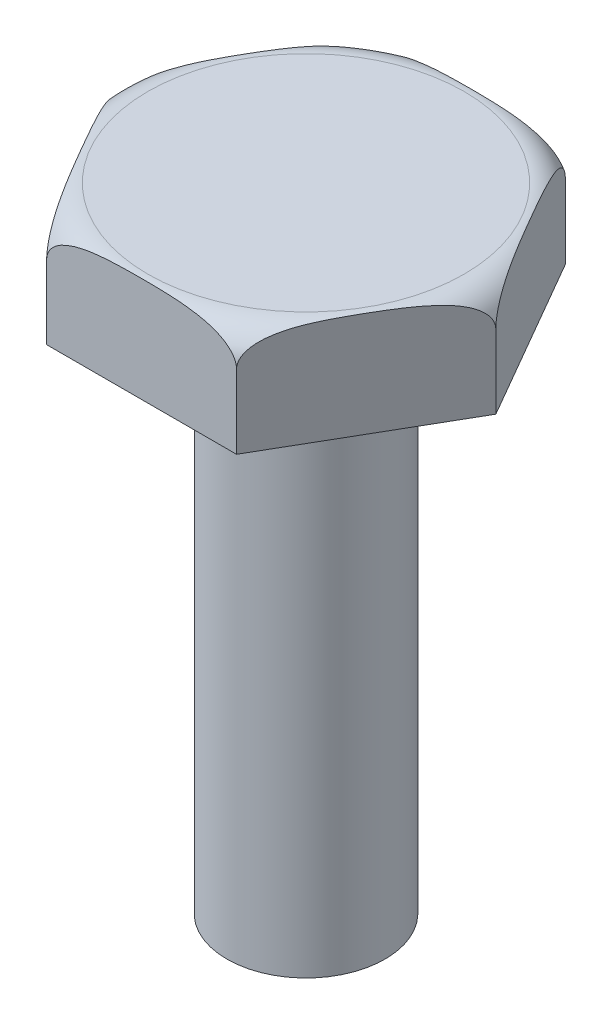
ISO-10303-21;
HEADER;
FILE_DESCRIPTION(('STEP AP214'),'2;1');
FILE_NAME('part.step','',(''),(''),'','','');
FILE_SCHEMA(('AUTOMOTIVE_DESIGN { 1 0 10303 214 1 1 1 1 }'));
ENDSEC;
DATA;
#1=APPLICATION_CONTEXT('core data for automotive mechanical design processes');
#2=APPLICATION_PROTOCOL_DEFINITION('international standard','automotive_design',2000,#1);
#3=PRODUCT_CONTEXT('',#1,'mechanical');
#4=PRODUCT('Part','Part','',(#3));
#5=PRODUCT_RELATED_PRODUCT_CATEGORY('part','',(#4));
#6=PRODUCT_DEFINITION_FORMATION('','',#4);
#7=PRODUCT_DEFINITION_CONTEXT('part definition',#1,'design');
#8=PRODUCT_DEFINITION('design','',#6,#7);
#9=PRODUCT_DEFINITION_SHAPE('','',#8);
#10=(LENGTH_UNIT() NAMED_UNIT(*) SI_UNIT(.MILLI.,.METRE.));
#11=(NAMED_UNIT(*) PLANE_ANGLE_UNIT() SI_UNIT($,.RADIAN.));
#12=(NAMED_UNIT(*) SI_UNIT($,.STERADIAN.) SOLID_ANGLE_UNIT());
#13=UNCERTAINTY_MEASURE_WITH_UNIT(LENGTH_MEASURE(1.E-05),#10,'distance_accuracy_value','');
#14=(GEOMETRIC_REPRESENTATION_CONTEXT(3) GLOBAL_UNCERTAINTY_ASSIGNED_CONTEXT((#13)) GLOBAL_UNIT_ASSIGNED_CONTEXT((#10,
#11,#12)) REPRESENTATION_CONTEXT('',''));
#15=CARTESIAN_POINT('',(0.,0.,0.));
#16=DIRECTION('',(0.,0.,1.));
#17=DIRECTION('',(1.,0.,0.));
#18=AXIS2_PLACEMENT_3D('',#15,#16,#17);
#19=CARTESIAN_POINT('',(0.,50.,0.));
#20=DIRECTION('',(0.,-1.,0.));
#21=DIRECTION('',(0.,0.,-1.));
#22=AXIS2_PLACEMENT_3D('',#19,#20,#21);
#23=CYLINDRICAL_SURFACE('',#22,7.5);
#24=CARTESIAN_POINT('',(0.,50.,0.));
#25=DIRECTION('',(0.,1.,0.));
#26=DIRECTION('',(0.,0.,1.));
#27=AXIS2_PLACEMENT_3D('',#24,#25,#26);
#28=CIRCLE('',#27,7.5);
#29=CARTESIAN_POINT('',(0.,50.,7.5));
#30=VERTEX_POINT('',#29);
#31=EDGE_CURVE('E11',#30,#30,#28,.T.);
#32=ORIENTED_EDGE('',*,*,#31,.F.);
#33=EDGE_LOOP('',(#32));
#34=FACE_BOUND('',#33,.T.);
#35=CARTESIAN_POINT('',(0.,0.,0.));
#36=DIRECTION('',(0.,1.,0.));
#37=DIRECTION('',(0.,0.,1.));
#38=AXIS2_PLACEMENT_3D('',#35,#36,#37);
#39=CIRCLE('',#38,7.5);
#40=CARTESIAN_POINT('',(0.,0.,7.5));
#41=VERTEX_POINT('',#40);
#42=EDGE_CURVE('E35',#41,#41,#39,.T.);
#43=ORIENTED_EDGE('',*,*,#42,.T.);
#44=EDGE_LOOP('',(#43));
#45=FACE_BOUND('',#44,.T.);
#46=ADVANCED_FACE('F32',(#34,#45),#23,.T.);
#47=CARTESIAN_POINT('',(0.,0.,0.));
#48=DIRECTION('',(0.,1.,0.));
#49=DIRECTION('',(0.,0.,1.));
#50=AXIS2_PLACEMENT_3D('',#47,#48,#49);
#51=PLANE('',#50);
#52=ORIENTED_EDGE('',*,*,#42,.F.);
#53=EDGE_LOOP('',(#52));
#54=FACE_BOUND('',#53,.T.);
#55=ADVANCED_FACE('F183',(#54),#51,.F.);
#56=CARTESIAN_POINT('',(9.,50.,15.5884572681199));
#57=DIRECTION('',(0.,-1.,0.));
#58=DIRECTION('',(0.,0.,-1.));
#59=AXIS2_PLACEMENT_3D('',#56,#57,#58);
#60=PLANE('',#59);
#61=DIRECTION('',(0.5,0.,-0.866025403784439));
#62=VECTOR('',#61,1.);
#63=CARTESIAN_POINT('',(9.,50.,15.5884572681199));
#64=LINE('',#63,#62);
#65=CARTESIAN_POINT('',(9.,50.,15.5884572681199));
#66=VERTEX_POINT('',#65);
#67=CARTESIAN_POINT('',(18.,50.,0.));
#68=VERTEX_POINT('',#67);
#69=EDGE_CURVE('E128',#66,#68,#64,.T.);
#70=ORIENTED_EDGE('',*,*,#69,.F.);
#71=DIRECTION('',(1.,0.,0.));
#72=VECTOR('',#71,1.);
#73=CARTESIAN_POINT('',(-9.,50.,15.5884572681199));
#74=LINE('',#73,#72);
#75=CARTESIAN_POINT('',(-9.,50.,15.5884572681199));
#76=VERTEX_POINT('',#75);
#77=EDGE_CURVE('E117',#76,#66,#74,.T.);
#78=ORIENTED_EDGE('',*,*,#77,.F.);
#79=DIRECTION('',(0.5,0.,0.866025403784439));
#80=VECTOR('',#79,1.);
#81=CARTESIAN_POINT('',(-18.,50.,0.));
#82=LINE('',#81,#80);
#83=CARTESIAN_POINT('',(-18.,50.,0.));
#84=VERTEX_POINT('',#83);
#85=EDGE_CURVE('E119',#84,#76,#82,.T.);
#86=ORIENTED_EDGE('',*,*,#85,.F.);
#87=DIRECTION('',(-0.5,0.,0.866025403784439));
#88=VECTOR('',#87,1.);
#89=CARTESIAN_POINT('',(-9.,50.,-15.5884572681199));
#90=LINE('',#89,#88);
#91=CARTESIAN_POINT('',(-9.,50.,-15.5884572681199));
#92=VERTEX_POINT('',#91);
#93=EDGE_CURVE('E122',#92,#84,#90,.T.);
#94=ORIENTED_EDGE('',*,*,#93,.F.);
#95=DIRECTION('',(-1.,0.,0.));
#96=VECTOR('',#95,1.);
#97=CARTESIAN_POINT('',(8.99999999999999,50.,-15.5884572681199));
#98=LINE('',#97,#96);
#99=CARTESIAN_POINT('',(8.99999999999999,50.,-15.5884572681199));
#100=VERTEX_POINT('',#99);
#101=EDGE_CURVE('E125',#100,#92,#98,.T.);
#102=ORIENTED_EDGE('',*,*,#101,.F.);
#103=DIRECTION('',(-0.5,0.,-0.866025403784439));
#104=VECTOR('',#103,1.);
#105=CARTESIAN_POINT('',(18.,50.,0.));
#106=LINE('',#105,#104);
#107=EDGE_CURVE('E105',#68,#100,#106,.T.);
#108=ORIENTED_EDGE('',*,*,#107,.F.);
#109=EDGE_LOOP('',(#70,#78,#86,#94,#102,#108));
#110=FACE_BOUND('',#109,.T.);
#111=ORIENTED_EDGE('',*,*,#31,.T.);
#112=EDGE_LOOP('',(#111));
#113=FACE_BOUND('',#112,.T.);
#114=ADVANCED_FACE('F181',(#110,#113),#60,.T.);
#115=CARTESIAN_POINT('',(9.,60.,15.5884572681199));
#116=DIRECTION('',(-0.866025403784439,0.,-0.5));
#117=DIRECTION('',(-0.5,0.,0.866025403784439));
#118=AXIS2_PLACEMENT_3D('',#115,#116,#117);
#119=PLANE('',#118);
#120=DIRECTION('',(0.,-1.,0.));
#121=VECTOR('',#120,1.);
#122=CARTESIAN_POINT('',(18.,60.,0.));
#123=LINE('',#122,#121);
#124=CARTESIAN_POINT('',(18.,57.,0.));
#125=VERTEX_POINT('',#124);
#126=EDGE_CURVE('E107',#125,#68,#123,.T.);
#127=ORIENTED_EDGE('',*,*,#126,.F.);
#128=CARTESIAN_POINT('',(17.9999999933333,56.9998,1.15469960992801E-08));
#129=CARTESIAN_POINT('',(18.0000073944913,57.044574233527,-1.28076347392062E-05));
#130=CARTESIAN_POINT('',(17.9990027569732,57.0893241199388,0.00172727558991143));
#131=CARTESIAN_POINT('',(17.9950180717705,57.178437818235,0.00862895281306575));
#132=CARTESIAN_POINT('',(17.9920395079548,57.2228018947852,0.0137879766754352));
#133=CARTESIAN_POINT('',(17.980283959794,57.3541241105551,0.0341491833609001));
#134=CARTESIAN_POINT('',(17.9686852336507,57.4401226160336,0.0542387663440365));
#135=CARTESIAN_POINT('',(17.9388771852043,57.6070109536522,0.105867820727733));
#136=CARTESIAN_POINT('',(17.9206857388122,57.6879139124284,0.137376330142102));
#137=CARTESIAN_POINT('',(17.8787905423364,57.8439250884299,0.209940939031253));
#138=CARTESIAN_POINT('',(17.8550748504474,57.9190202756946,0.251017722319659));
#139=CARTESIAN_POINT('',(17.7868210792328,58.1084304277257,0.369236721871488));
#140=CARTESIAN_POINT('',(17.7386113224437,58.2174436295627,0.452738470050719));
#141=CARTESIAN_POINT('',(17.6343360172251,58.4192265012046,0.633348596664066));
#142=CARTESIAN_POINT('',(17.5782492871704,58.5119508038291,0.730493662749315));
#143=CARTESIAN_POINT('',(17.4694023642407,58.670549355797,0.919022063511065));
#144=CARTESIAN_POINT('',(17.4173364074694,58.7383673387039,1.00920294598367));
#145=CARTESIAN_POINT('',(17.3104531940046,58.8647928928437,1.1943301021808));
#146=CARTESIAN_POINT('',(17.2556338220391,58.9233932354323,1.28928003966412));
#147=CARTESIAN_POINT('',(17.1439830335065,59.0325905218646,1.48266487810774));
#148=CARTESIAN_POINT('',(17.0871494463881,59.0831784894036,1.58110353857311));
#149=CARTESIAN_POINT('',(16.9720805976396,59.1773153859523,1.78040863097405));
#150=CARTESIAN_POINT('',(16.91384582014,59.2208667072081,1.88127422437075));
#151=CARTESIAN_POINT('',(16.7707588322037,59.3195083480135,2.12910815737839));
#152=CARTESIAN_POINT('',(16.6853521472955,59.3713720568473,2.2770368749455));
#153=CARTESIAN_POINT('',(16.5131280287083,59.4648256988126,2.57533779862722));
#154=CARTESIAN_POINT('',(16.4263098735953,59.5064101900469,2.72571125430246));
#155=CARTESIAN_POINT('',(16.2516022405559,59.5811767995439,3.0283137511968));
#156=CARTESIAN_POINT('',(16.1637109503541,59.6143417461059,3.18054593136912));
#157=CARTESIAN_POINT('',(15.9873653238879,59.6736657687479,3.48598551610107));
#158=CARTESIAN_POINT('',(15.8989110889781,59.6998260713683,3.63919274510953));
#159=CARTESIAN_POINT('',(15.7209469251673,59.7465847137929,3.94743571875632));
#160=CARTESIAN_POINT('',(15.6314341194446,59.7671385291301,4.10247644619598));
#161=CARTESIAN_POINT('',(15.4521686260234,59.8034914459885,4.41297338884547));
#162=CARTESIAN_POINT('',(15.3624159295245,59.8192903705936,4.56842961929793));
#163=CARTESIAN_POINT('',(15.1828700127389,59.8470185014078,4.87941226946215));
#164=CARTESIAN_POINT('',(15.0930769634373,59.8589522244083,5.03493839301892));
#165=CARTESIAN_POINT('',(14.9134003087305,59.8797205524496,5.34614748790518));
#166=CARTESIAN_POINT('',(14.8235167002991,59.8885550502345,5.50183046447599));
#167=CARTESIAN_POINT('',(14.5888904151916,59.9083822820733,5.90821511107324));
#168=CARTESIAN_POINT('',(14.4441067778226,59.9174077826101,6.15898772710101));
#169=CARTESIAN_POINT('',(14.1544855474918,59.9309485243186,6.66062641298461));
#170=CARTESIAN_POINT('',(14.009647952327,59.9354635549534,6.9114924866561));
#171=CARTESIAN_POINT('',(13.7198370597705,59.9410488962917,7.41345967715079));
#172=CARTESIAN_POINT('',(13.5748637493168,59.9421163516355,7.66456081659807));
#173=CARTESIAN_POINT('',(13.2849251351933,59.9410717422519,8.16674922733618));
#174=CARTESIAN_POINT('',(13.1399598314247,59.9389597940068,8.41783649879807));
#175=CARTESIAN_POINT('',(12.8511585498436,59.9310560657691,8.91805499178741));
#176=CARTESIAN_POINT('',(12.7073223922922,59.9252924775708,9.16718652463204));
#177=CARTESIAN_POINT('',(12.4197008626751,59.9088125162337,9.66536162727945));
#178=CARTESIAN_POINT('',(12.2759154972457,59.8980956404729,9.91440518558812));
#179=CARTESIAN_POINT('',(11.9886638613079,59.8696306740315,10.4119396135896));
#180=CARTESIAN_POINT('',(11.845197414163,59.8518900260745,10.6604307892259));
#181=CARTESIAN_POINT('',(11.5586671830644,59.8064609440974,11.1567157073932));
#182=CARTESIAN_POINT('',(11.4156033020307,59.7787751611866,11.4045096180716));
#183=CARTESIAN_POINT('',(11.2062028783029,59.7279341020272,11.7672017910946));
#184=CARTESIAN_POINT('',(11.1395366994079,59.7102039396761,11.8826710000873));
#185=CARTESIAN_POINT('',(11.0064554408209,59.6711884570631,12.1131745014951));
#186=CARTESIAN_POINT('',(10.9400403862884,59.6499027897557,12.2282087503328));
#187=CARTESIAN_POINT('',(10.8071934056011,59.603082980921,12.4583064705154));
#188=CARTESIAN_POINT('',(10.7407635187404,59.5775254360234,12.5733664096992));
#189=CARTESIAN_POINT('',(10.6084149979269,59.521583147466,12.8026007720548));
#190=CARTESIAN_POINT('',(10.5424963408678,59.4911986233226,12.9167752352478));
#191=CARTESIAN_POINT('',(10.3859430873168,59.4119798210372,13.1879334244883));
#192=CARTESIAN_POINT('',(10.2956278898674,59.3605584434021,13.3443639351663));
#193=CARTESIAN_POINT('',(10.1170166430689,59.2444241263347,13.6537276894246));
#194=CARTESIAN_POINT('',(10.0287226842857,59.1796980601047,13.8066573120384));
#195=CARTESIAN_POINT('',(9.85623944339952,59.034486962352,14.1054070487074));
#196=CARTESIAN_POINT('',(9.77202218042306,58.9541371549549,14.251275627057));
#197=CARTESIAN_POINT('',(9.60913695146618,58.7737131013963,14.5334011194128));
#198=CARTESIAN_POINT('',(9.53045441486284,58.6736934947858,14.6696832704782));
#199=CARTESIAN_POINT('',(9.40984053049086,58.4914534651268,14.8785926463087));
#200=CARTESIAN_POINT('',(9.36516192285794,58.4165455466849,14.9559782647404));
#201=CARTESIAN_POINT('',(9.28066773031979,58.2561112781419,15.102326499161));
#202=CARTESIAN_POINT('',(9.2408574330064,58.1705735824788,15.1712799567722));
#203=CARTESIAN_POINT('',(9.167614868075,57.9872355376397,15.29813980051));
#204=CARTESIAN_POINT('',(9.13426811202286,57.8892958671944,15.35589807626));
#205=CARTESIAN_POINT('',(9.0772599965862,57.6829255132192,15.45463902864));
#206=CARTESIAN_POINT('',(9.05355846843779,57.5745407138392,15.4956912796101));
#207=CARTESIAN_POINT('',(9.0242567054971,57.3878478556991,15.5464434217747));
#208=CARTESIAN_POINT('',(9.01525008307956,57.3116733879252,15.5620433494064));
#209=CARTESIAN_POINT('',(9.00614499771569,57.1957970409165,15.5778138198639));
#210=CARTESIAN_POINT('',(9.00384387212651,57.1567596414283,15.581799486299));
#211=CARTESIAN_POINT('',(9.00076788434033,57.0784194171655,15.5871272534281));
#212=CARTESIAN_POINT('',(8.99999404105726,57.0391164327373,15.5884675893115));
#213=CARTESIAN_POINT('',(9.00000000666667,56.9998,15.5884572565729));
#214=B_SPLINE_CURVE_WITH_KNOTS('',3,(#128,#129,#130,#131,#132,#133,#134,#135,#136,#137,#138,
#139,#140,#141,#142,#143,#144,#145,#146,#147,#148,#149,#150,#151,#152,#153,#154,#155,#156,#157,
#158,#159,#160,#161,#162,#163,#164,#165,#166,#167,#168,#169,#170,#171,#172,#173,#174,#175,#176,
#177,#178,#179,#180,#181,#182,#183,#184,#185,#186,#187,#188,#189,#190,#191,#192,#193,#194,#195,
#196,#197,#198,#199,#200,#201,#202,#203,#204,#205,#206,#207,#208,#209,#210,#211,#212,#213),
.UNSPECIFIED.,.F.,.F.,(4,2,2,2,2,2,2,2,2,2,2,2,2,2,2,2,2,2,2,2,2,2,2,2,2,2,2,2,2,2,2,2,2,2,2,2,
2,2,2,2,2,2,4),(0.,0.134231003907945,0.268361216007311,0.534224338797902,0.799371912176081,
1.06509806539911,1.49920982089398,1.93451211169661,2.30678445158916,2.67934729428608,
3.05232461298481,3.42517486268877,3.96028677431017,4.49568137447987,5.03215929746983,
5.56854321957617,6.1090704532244,6.64961779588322,7.18953116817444,7.72946322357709,
8.59853080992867,9.46763896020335,10.3374667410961,11.2072626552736,12.0704239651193,
12.9336728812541,13.7960094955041,14.6581164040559,15.0615961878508,15.4651153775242,
15.8709224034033,16.2767109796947,16.8397230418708,17.4032932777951,17.9621870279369,
18.5195496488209,18.8686635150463,19.2181532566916,19.5719910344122,19.9243397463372,
20.1582732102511,20.2760875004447,20.3939803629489),.UNSPECIFIED.);
#215=CARTESIAN_POINT('',(8.99999999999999,57.,15.5884572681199));
#216=VERTEX_POINT('',#215);
#217=EDGE_CURVE('E89',#125,#216,#214,.T.);
#218=ORIENTED_EDGE('',*,*,#217,.T.);
#219=DIRECTION('',(0.,-1.,0.));
#220=VECTOR('',#219,1.);
#221=CARTESIAN_POINT('',(9.,60.,15.5884572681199));
#222=LINE('',#221,#220);
#223=EDGE_CURVE('E54',#216,#66,#222,.T.);
#224=ORIENTED_EDGE('',*,*,#223,.T.);
#225=ORIENTED_EDGE('',*,*,#69,.T.);
#226=EDGE_LOOP('',(#127,#218,#224,#225));
#227=FACE_BOUND('',#226,.T.);
#228=ADVANCED_FACE('F139',(#227),#119,.F.);
#229=CARTESIAN_POINT('',(18.,60.,0.));
#230=DIRECTION('',(-0.866025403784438,0.,0.5));
#231=DIRECTION('',(0.5,0.,0.866025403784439));
#232=AXIS2_PLACEMENT_3D('',#229,#230,#231);
#233=PLANE('',#232);
#234=DIRECTION('',(0.,-1.,0.));
#235=VECTOR('',#234,1.);
#236=CARTESIAN_POINT('',(8.99999999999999,60.,-15.5884572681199));
#237=LINE('',#236,#235);
#238=CARTESIAN_POINT('',(8.99999999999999,57.,-15.5884572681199));
#239=VERTEX_POINT('',#238);
#240=EDGE_CURVE('E98',#239,#100,#237,.T.);
#241=ORIENTED_EDGE('',*,*,#240,.F.);
#242=CARTESIAN_POINT('',(9.00000000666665,56.9998,-15.5884572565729));
#243=CARTESIAN_POINT('',(8.99999260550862,57.044574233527,-15.5884700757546));
#244=CARTESIAN_POINT('',(9.00099724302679,57.0893241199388,-15.58672999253));
#245=CARTESIAN_POINT('',(9.00498192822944,57.178437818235,-15.5798283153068));
#246=CARTESIAN_POINT('',(9.00796049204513,57.2228018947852,-15.5746692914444));
#247=CARTESIAN_POINT('',(9.01971604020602,57.3541241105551,-15.554308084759));
#248=CARTESIAN_POINT('',(9.03131476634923,57.4401226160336,-15.5342185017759));
#249=CARTESIAN_POINT('',(9.06112281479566,57.6070109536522,-15.4825894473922));
#250=CARTESIAN_POINT('',(9.07931426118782,57.6879139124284,-15.4510809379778));
#251=CARTESIAN_POINT('',(9.12120945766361,57.8439250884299,-15.3785163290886));
#252=CARTESIAN_POINT('',(9.14492514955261,57.9190202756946,-15.3374395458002));
#253=CARTESIAN_POINT('',(9.21317892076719,58.1084304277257,-15.2192205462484));
#254=CARTESIAN_POINT('',(9.26138867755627,58.2174436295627,-15.1357187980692));
#255=CARTESIAN_POINT('',(9.36566398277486,58.4192265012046,-14.9551086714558));
#256=CARTESIAN_POINT('',(9.42175071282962,58.5119508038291,-14.8579636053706));
#257=CARTESIAN_POINT('',(9.5305976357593,58.670549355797,-14.6694352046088));
#258=CARTESIAN_POINT('',(9.58266359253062,58.7383673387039,-14.5792543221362));
#259=CARTESIAN_POINT('',(9.68954680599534,58.8647928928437,-14.3941271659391));
#260=CARTESIAN_POINT('',(9.74436617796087,58.9233932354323,-14.2991772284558));
#261=CARTESIAN_POINT('',(9.85601696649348,59.0325905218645,-14.1057923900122));
#262=CARTESIAN_POINT('',(9.91285055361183,59.0831784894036,-14.0073537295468));
#263=CARTESIAN_POINT('',(10.0279194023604,59.1773153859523,-13.8080486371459));
#264=CARTESIAN_POINT('',(10.0861541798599,59.2208667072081,-13.7071830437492));
#265=CARTESIAN_POINT('',(10.2292411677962,59.3195083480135,-13.4593491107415));
#266=CARTESIAN_POINT('',(10.3146478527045,59.3713720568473,-13.3114203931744));
#267=CARTESIAN_POINT('',(10.4868719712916,59.4648256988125,-13.0131194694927));
#268=CARTESIAN_POINT('',(10.5736901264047,59.5064101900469,-12.8627460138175));
#269=CARTESIAN_POINT('',(10.7483977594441,59.5811767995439,-12.5601435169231));
#270=CARTESIAN_POINT('',(10.8362890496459,59.6143417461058,-12.4079113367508));
#271=CARTESIAN_POINT('',(11.012634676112,59.6736657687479,-12.1024717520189));
#272=CARTESIAN_POINT('',(11.1010889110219,59.6998260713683,-11.9492645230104));
#273=CARTESIAN_POINT('',(11.2790530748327,59.7465847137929,-11.6410215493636));
#274=CARTESIAN_POINT('',(11.3685658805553,59.7671385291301,-11.485980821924));
#275=CARTESIAN_POINT('',(11.5478313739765,59.8034914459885,-11.1754838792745));
#276=CARTESIAN_POINT('',(11.6375840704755,59.8192903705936,-11.020027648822));
#277=CARTESIAN_POINT('',(11.8171299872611,59.8470185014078,-10.7090449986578));
#278=CARTESIAN_POINT('',(11.9069230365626,59.8589522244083,-10.5535188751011));
#279=CARTESIAN_POINT('',(12.0865996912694,59.8797205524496,-10.2423097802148));
#280=CARTESIAN_POINT('',(12.1764832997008,59.8885550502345,-10.086626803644));
#281=CARTESIAN_POINT('',(12.4111095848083,59.9083822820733,-9.68024215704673));
#282=CARTESIAN_POINT('',(12.5558932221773,59.9174077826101,-9.42946954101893));
#283=CARTESIAN_POINT('',(12.8455144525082,59.9309485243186,-8.92783085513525));
#284=CARTESIAN_POINT('',(12.990352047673,59.9354635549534,-8.67696478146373));
#285=CARTESIAN_POINT('',(13.2801629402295,59.9410488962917,-8.17499759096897));
#286=CARTESIAN_POINT('',(13.4251362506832,59.9421163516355,-7.92389645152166));
#287=CARTESIAN_POINT('',(13.7150748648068,59.9410717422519,-7.42170804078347));
#288=CARTESIAN_POINT('',(13.8600401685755,59.9389597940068,-7.17062076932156));
#289=CARTESIAN_POINT('',(14.1488414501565,59.9310560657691,-6.67040227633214));
#290=CARTESIAN_POINT('',(14.292677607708,59.9252924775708,-6.42127074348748));
#291=CARTESIAN_POINT('',(14.5802991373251,59.9088125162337,-5.92309564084));
#292=CARTESIAN_POINT('',(14.7240845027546,59.8980956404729,-5.6740520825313));
#293=CARTESIAN_POINT('',(15.0113361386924,59.8696306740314,-5.17651765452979));
#294=CARTESIAN_POINT('',(15.1548025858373,59.8518900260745,-4.92802647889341));
#295=CARTESIAN_POINT('',(15.441332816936,59.8064609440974,-4.43174156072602));
#296=CARTESIAN_POINT('',(15.5843966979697,59.7787751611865,-4.18394765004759));
#297=CARTESIAN_POINT('',(15.7937971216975,59.7279341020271,-3.82125547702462));
#298=CARTESIAN_POINT('',(15.8604633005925,59.710203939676,-3.70578626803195));
#299=CARTESIAN_POINT('',(15.9935445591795,59.671188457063,-3.47528276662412));
#300=CARTESIAN_POINT('',(16.0599596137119,59.6499027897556,-3.36024851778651));
#301=CARTESIAN_POINT('',(16.1928065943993,59.6030829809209,-3.13015079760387));
#302=CARTESIAN_POINT('',(16.2592364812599,59.5775254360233,-3.01509085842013));
#303=CARTESIAN_POINT('',(16.3915850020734,59.5215831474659,-2.78585649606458));
#304=CARTESIAN_POINT('',(16.4575036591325,59.4911986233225,-2.67168203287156));
#305=CARTESIAN_POINT('',(16.6140569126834,59.411979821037,-2.40052384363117));
#306=CARTESIAN_POINT('',(16.7043721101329,59.3605584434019,-2.24409333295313));
#307=CARTESIAN_POINT('',(16.8829833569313,59.2444241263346,-1.93472957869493));
#308=CARTESIAN_POINT('',(16.9712773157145,59.1796980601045,-1.78179995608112));
#309=CARTESIAN_POINT('',(17.1437605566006,59.0344869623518,-1.4830502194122));
#310=CARTESIAN_POINT('',(17.2279778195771,58.9541371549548,-1.33718164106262));
#311=CARTESIAN_POINT('',(17.3908630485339,58.7737131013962,-1.05505614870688));
#312=CARTESIAN_POINT('',(17.4695455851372,58.6736934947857,-0.918773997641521));
#313=CARTESIAN_POINT('',(17.5901594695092,58.4914534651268,-0.709864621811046));
#314=CARTESIAN_POINT('',(17.6348380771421,58.4165455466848,-0.632479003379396));
#315=CARTESIAN_POINT('',(17.7193322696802,58.2561112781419,-0.486130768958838));
#316=CARTESIAN_POINT('',(17.7591425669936,58.1705735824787,-0.417177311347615));
#317=CARTESIAN_POINT('',(17.832385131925,57.9872355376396,-0.290317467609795));
#318=CARTESIAN_POINT('',(17.8657318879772,57.8892958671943,-0.232559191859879));
#319=CARTESIAN_POINT('',(17.9227400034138,57.6829255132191,-0.133818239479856));
#320=CARTESIAN_POINT('',(17.9464415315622,57.5745407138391,-0.0927659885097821));
#321=CARTESIAN_POINT('',(17.9757432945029,57.387847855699,-0.0420138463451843));
#322=CARTESIAN_POINT('',(17.9847499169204,57.3116733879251,-0.0264139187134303));
#323=CARTESIAN_POINT('',(17.9938550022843,57.1957970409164,-0.0106434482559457));
#324=CARTESIAN_POINT('',(17.9961561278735,57.1567596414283,-0.00665778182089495));
#325=CARTESIAN_POINT('',(17.9992321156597,57.0784194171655,-0.00133001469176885));
#326=CARTESIAN_POINT('',(18.0000059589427,57.0391164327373,1.03211915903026E-05));
#327=CARTESIAN_POINT('',(17.9999999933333,56.9998,-1.15470031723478E-08));
#328=B_SPLINE_CURVE_WITH_KNOTS('',3,(#242,#243,#244,#245,#246,#247,#248,#249,#250,#251,#252,
#253,#254,#255,#256,#257,#258,#259,#260,#261,#262,#263,#264,#265,#266,#267,#268,#269,#270,#271,
#272,#273,#274,#275,#276,#277,#278,#279,#280,#281,#282,#283,#284,#285,#286,#287,#288,#289,#290,
#291,#292,#293,#294,#295,#296,#297,#298,#299,#300,#301,#302,#303,#304,#305,#306,#307,#308,#309,
#310,#311,#312,#313,#314,#315,#316,#317,#318,#319,#320,#321,#322,#323,#324,#325,#326,#327),
.UNSPECIFIED.,.F.,.F.,(4,2,2,2,2,2,2,2,2,2,2,2,2,2,2,2,2,2,2,2,2,2,2,2,2,2,2,2,2,2,2,2,2,2,2,2,
2,2,2,2,2,2,4),(0.,0.134231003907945,0.268361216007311,0.534224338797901,0.799371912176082,
1.06509806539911,1.49920982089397,1.93451211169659,2.30678445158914,2.67934729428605,
3.05232461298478,3.42517486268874,3.96028677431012,4.49568137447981,5.03215929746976,
5.56854321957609,6.10907045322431,6.64961779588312,7.18953116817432,7.72946322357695,
8.59853080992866,9.46763896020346,10.3374667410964,11.207262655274,12.0704239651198,
12.9336728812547,13.7960094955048,14.6581164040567,15.0615961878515,15.4651153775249,
15.870922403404,16.2767109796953,16.8397230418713,17.4032932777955,17.9621870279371,
18.519549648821,18.8686635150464,19.2181532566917,19.5719910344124,19.9243397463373,
20.1582732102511,20.2760875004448,20.3939803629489),.UNSPECIFIED.);
#329=EDGE_CURVE('E84',#239,#125,#328,.T.);
#330=ORIENTED_EDGE('',*,*,#329,.T.);
#331=ORIENTED_EDGE('',*,*,#126,.T.);
#332=ORIENTED_EDGE('',*,*,#107,.T.);
#333=EDGE_LOOP('',(#241,#330,#331,#332));
#334=FACE_BOUND('',#333,.T.);
#335=ADVANCED_FACE('F103',(#334),#233,.F.);
#336=CARTESIAN_POINT('',(8.99999999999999,60.,-15.5884572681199));
#337=DIRECTION('',(0.,0.,1.));
#338=DIRECTION('',(1.,0.,0.));
#339=AXIS2_PLACEMENT_3D('',#336,#337,#338);
#340=PLANE('',#339);
#341=DIRECTION('',(0.,-1.,0.));
#342=VECTOR('',#341,1.);
#343=CARTESIAN_POINT('',(-9.,60.,-15.5884572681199));
#344=LINE('',#343,#342);
#345=CARTESIAN_POINT('',(-9.00000000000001,57.,-15.5884572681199));
#346=VERTEX_POINT('',#345);
#347=EDGE_CURVE('E100',#346,#92,#344,.T.);
#348=ORIENTED_EDGE('',*,*,#347,.F.);
#349=CARTESIAN_POINT('',(0.,59.9417202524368,-15.5884572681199));
#350=CARTESIAN_POINT('',(0.251908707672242,59.9417169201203,-15.5884572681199));
#351=CARTESIAN_POINT('',(0.503816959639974,59.9405168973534,-15.5884572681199));
#352=CARTESIAN_POINT('',(1.0076095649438,59.9354806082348,-15.5884572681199));
#353=CARTESIAN_POINT('',(1.25949391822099,59.9316443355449,-15.5884572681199));
#354=CARTESIAN_POINT('',(1.76350599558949,59.9206479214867,-15.5884572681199));
#355=CARTESIAN_POINT('',(2.01563363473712,59.9134836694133,-15.5884572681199));
#356=CARTESIAN_POINT('',(2.51971985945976,59.8946799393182,-15.5884572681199));
#357=CARTESIAN_POINT('',(2.77167845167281,59.8830406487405,-15.5884572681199));
#358=CARTESIAN_POINT('',(3.27392205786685,59.8537366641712,-15.5884572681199));
#359=CARTESIAN_POINT('',(3.52420887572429,59.8361041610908,-15.5884572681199));
#360=CARTESIAN_POINT('',(4.02416038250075,59.7926812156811,-15.5884572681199));
#361=CARTESIAN_POINT('',(4.27382491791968,59.7668889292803,-15.5884572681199));
#362=CARTESIAN_POINT('',(4.7712435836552,59.7045041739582,-15.5884572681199));
#363=CARTESIAN_POINT('',(5.01900081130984,59.6679370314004,-15.5884572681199));
#364=CARTESIAN_POINT('',(5.51194713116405,59.5805562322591,-15.5884572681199));
#365=CARTESIAN_POINT('',(5.75713778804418,59.5297518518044,-15.5884572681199));
#366=CARTESIAN_POINT('',(6.11931943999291,59.4400073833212,-15.5884572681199));
#367=CARTESIAN_POINT('',(6.23807683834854,59.4081786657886,-15.5884572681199));
#368=CARTESIAN_POINT('',(6.47411573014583,59.3393076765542,-15.5884572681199));
#369=CARTESIAN_POINT('',(6.59139685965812,59.3022641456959,-15.5884572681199));
#370=CARTESIAN_POINT('',(6.82400951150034,59.2221860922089,-15.5884572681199));
#371=CARTESIAN_POINT('',(6.93933960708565,59.1791473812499,-15.5884572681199));
#372=CARTESIAN_POINT('',(7.16718198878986,59.0862226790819,-15.5884572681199));
#373=CARTESIAN_POINT('',(7.27969497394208,59.0363384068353,-15.5884572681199));
#374=CARTESIAN_POINT('',(7.56355666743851,58.8982581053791,-15.5884572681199));
#375=CARTESIAN_POINT('',(7.73220323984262,58.8043474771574,-15.5884572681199));
#376=CARTESIAN_POINT('',(8.05393658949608,58.59271222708,-15.5884572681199));
#377=CARTESIAN_POINT('',(8.20706302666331,58.4750507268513,-15.5884572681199));
#378=CARTESIAN_POINT('',(8.42983524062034,58.265011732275,-15.5884572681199));
#379=CARTESIAN_POINT('',(8.5080969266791,58.1818264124,-15.5884572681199));
#380=CARTESIAN_POINT('',(8.65169101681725,58.0048838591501,-15.5884572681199));
#381=CARTESIAN_POINT('',(8.71703976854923,57.9111402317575,-15.5884572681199));
#382=CARTESIAN_POINT('',(8.82047539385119,57.7307772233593,-15.5884572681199));
#383=CARTESIAN_POINT('',(8.86132786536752,57.6457594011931,-15.5884572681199));
#384=CARTESIAN_POINT('',(8.92839984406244,57.4700963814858,-15.5884572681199));
#385=CARTESIAN_POINT('',(8.95463096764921,57.3794557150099,-15.5884572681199));
#386=CARTESIAN_POINT('',(8.99032175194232,57.1942593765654,-15.5884572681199));
#387=CARTESIAN_POINT('',(8.99967307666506,57.0996823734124,-15.5884572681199));
#388=CARTESIAN_POINT('',(9.00030974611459,56.9104696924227,-15.5884572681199));
#389=CARTESIAN_POINT('',(8.99159736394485,56.8158340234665,-15.5884572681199));
#390=CARTESIAN_POINT('',(8.95877175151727,56.6392373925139,-15.5884572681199));
#391=CARTESIAN_POINT('',(8.93630107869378,56.5569609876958,-15.5884572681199));
#392=CARTESIAN_POINT('',(8.87914905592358,56.396816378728,-15.5884572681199));
#393=CARTESIAN_POINT('',(8.84446435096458,56.3189493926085,-15.5884572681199));
#394=CARTESIAN_POINT('',(8.74759840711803,56.1360662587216,-15.5884572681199));
#395=CARTESIAN_POINT('',(8.6800157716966,56.0339189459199,-15.5884572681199));
#396=CARTESIAN_POINT('',(8.52942779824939,55.8416348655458,-15.5884572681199));
#397=CARTESIAN_POINT('',(8.44638143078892,55.7515311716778,-15.5884572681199));
#398=CARTESIAN_POINT('',(8.2880749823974,55.6006842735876,-15.5884572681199));
#399=CARTESIAN_POINT('',(8.21485667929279,55.5377535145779,-15.5884572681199));
#400=CARTESIAN_POINT('',(8.06318926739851,55.4185061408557,-15.5884572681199));
#401=CARTESIAN_POINT('',(7.98473697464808,55.3621936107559,-15.5884572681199));
#402=CARTESIAN_POINT('',(7.74341168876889,55.2022546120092,-15.5884572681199));
#403=CARTESIAN_POINT('',(7.57456860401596,55.1076252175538,-15.5884572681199));
#404=CARTESIAN_POINT('',(7.23268327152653,54.9403144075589,-15.5884572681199));
#405=CARTESIAN_POINT('',(7.05990004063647,54.8670817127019,-15.5884572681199));
#406=CARTESIAN_POINT('',(6.70866689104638,54.7353748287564,-15.5884572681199));
#407=CARTESIAN_POINT('',(6.53021119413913,54.6769162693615,-15.5884572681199));
#408=CARTESIAN_POINT('',(6.16891728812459,54.5717911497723,-15.5884572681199));
#409=CARTESIAN_POINT('',(5.98606109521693,54.5251875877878,-15.5884572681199));
#410=CARTESIAN_POINT('',(5.71020706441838,54.4627400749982,-15.5884572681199));
#411=CARTESIAN_POINT('',(5.61802620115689,54.4431726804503,-15.5884572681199));
#412=CARTESIAN_POINT('',(5.4332213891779,54.4062787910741,-15.5884572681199));
#413=CARTESIAN_POINT('',(5.34059746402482,54.3889521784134,-15.5884572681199));
#414=CARTESIAN_POINT('',(5.03842549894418,54.335812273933,-15.5884572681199));
#415=CARTESIAN_POINT('',(4.82814971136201,54.3041155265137,-15.5884572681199));
#416=CARTESIAN_POINT('',(4.40652174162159,54.2488116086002,-15.5884572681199));
#417=CARTESIAN_POINT('',(4.1951693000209,54.2252064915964,-15.5884572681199));
#418=CARTESIAN_POINT('',(3.77165777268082,54.1843411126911,-15.5884572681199));
#419=CARTESIAN_POINT('',(3.55949810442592,54.1670870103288,-15.5884572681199));
#420=CARTESIAN_POINT('',(3.1348621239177,54.1375431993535,-15.5884572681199));
#421=CARTESIAN_POINT('',(2.92238583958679,54.1252530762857,-15.5884572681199));
#422=CARTESIAN_POINT('',(2.49629110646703,54.1044557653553,-15.5884572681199));
#423=CARTESIAN_POINT('',(2.28267183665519,54.0959659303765,-15.5884572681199));
#424=CARTESIAN_POINT('',(1.85533575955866,54.0819597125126,-15.5884572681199));
#425=CARTESIAN_POINT('',(1.64161895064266,54.0764433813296,-15.5884572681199));
#426=CARTESIAN_POINT('',(1.21426391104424,54.0677398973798,-15.5884572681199));
#427=CARTESIAN_POINT('',(1.00062570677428,54.0645513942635,-15.5884572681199));
#428=CARTESIAN_POINT('',(0.57333188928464,54.0600901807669,-15.5884572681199));
#429=CARTESIAN_POINT('',(0.359676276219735,54.0588174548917,-15.5884572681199));
#430=CARTESIAN_POINT('',(-0.0679777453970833,54.0580151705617,-15.5884572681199));
#431=CARTESIAN_POINT('',(-0.281976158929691,54.0584883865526,-15.5884572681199));
#432=CARTESIAN_POINT('',(-0.709963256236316,54.0612489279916,-15.5884572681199));
#433=CARTESIAN_POINT('',(-0.923951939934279,54.0635362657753,-15.5884572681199));
#434=CARTESIAN_POINT('',(-1.35200608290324,54.0702292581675,-15.5884572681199));
#435=CARTESIAN_POINT('',(-1.566071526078,54.0746359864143,-15.5884572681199));
#436=CARTESIAN_POINT('',(-1.99413094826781,54.0861097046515,-15.5884572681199));
#437=CARTESIAN_POINT('',(-2.20812492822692,54.0931766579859,-15.5884572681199));
#438=CARTESIAN_POINT('',(-2.63507923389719,54.1107177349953,-15.5884572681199));
#439=CARTESIAN_POINT('',(-2.84804013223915,54.1211774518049,-15.5884572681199));
#440=CARTESIAN_POINT('',(-3.27372054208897,54.146534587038,-15.5884572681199));
#441=CARTESIAN_POINT('',(-3.48644003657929,54.1614323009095,-15.5884572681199));
#442=CARTESIAN_POINT('',(-3.91124242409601,54.1969415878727,-15.5884572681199));
#443=CARTESIAN_POINT('',(-4.12332568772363,54.217548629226,-15.5884572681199));
#444=CARTESIAN_POINT('',(-4.54664231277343,54.2660674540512,-15.5884572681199));
#445=CARTESIAN_POINT('',(-4.75787583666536,54.2939777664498,-15.5884572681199));
#446=CARTESIAN_POINT('',(-5.07350437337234,54.342777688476,-15.5884572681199));
#447=CARTESIAN_POINT('',(-5.17843864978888,54.3601857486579,-15.5884572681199));
#448=CARTESIAN_POINT('',(-5.38784390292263,54.3976104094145,-15.5884572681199));
#449=CARTESIAN_POINT('',(-5.49231485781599,54.4176271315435,-15.5884572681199));
#450=CARTESIAN_POINT('',(-5.80503477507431,54.4820976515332,-15.5884572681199));
#451=CARTESIAN_POINT('',(-6.01241621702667,54.530945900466,-15.5884572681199));
#452=CARTESIAN_POINT('',(-6.42207445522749,54.6430830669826,-15.5884572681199));
#453=CARTESIAN_POINT('',(-6.6243729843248,54.706291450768,-15.5884572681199));
#454=CARTESIAN_POINT('',(-7.0222282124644,54.8511043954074,-15.5884572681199));
#455=CARTESIAN_POINT('',(-7.21779397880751,54.9326830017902,-15.5884572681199));
#456=CARTESIAN_POINT('',(-7.50362491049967,55.0730902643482,-15.5884572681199));
#457=CARTESIAN_POINT('',(-7.59816306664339,55.1232358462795,-15.5884572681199));
#458=CARTESIAN_POINT('',(-7.78331383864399,55.2302747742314,-15.5884572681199));
#459=CARTESIAN_POINT('',(-7.87392859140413,55.2871643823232,-15.5884572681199));
#460=CARTESIAN_POINT('',(-8.0497065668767,55.4083482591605,-15.5884572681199));
#461=CARTESIAN_POINT('',(-8.13488561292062,55.4726193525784,-15.5884572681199));
#462=CARTESIAN_POINT('',(-8.29821887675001,55.6094631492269,-15.5884572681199));
#463=CARTESIAN_POINT('',(-8.37638099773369,55.6820262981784,-15.5884572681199));
#464=CARTESIAN_POINT('',(-8.52148595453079,55.8342357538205,-15.5884572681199));
#465=CARTESIAN_POINT('',(-8.588663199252,55.913655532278,-15.5884572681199));
#466=CARTESIAN_POINT('',(-8.71114985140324,56.0812858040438,-15.5884572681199));
#467=CARTESIAN_POINT('',(-8.76646229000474,56.169494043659,-15.5884572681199));
#468=CARTESIAN_POINT('',(-8.86218213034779,56.3550856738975,-15.5884572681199));
#469=CARTESIAN_POINT('',(-8.90241493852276,56.452561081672,-15.5884572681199));
#470=CARTESIAN_POINT('',(-8.96326151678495,56.6534610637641,-15.5884572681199));
#471=CARTESIAN_POINT('',(-8.98390485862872,56.7568764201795,-15.5884572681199));
#472=CARTESIAN_POINT('',(-9.00213498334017,56.9535871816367,-15.5884572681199));
#473=CARTESIAN_POINT('',(-9.00212193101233,57.0466623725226,-15.5884572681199));
#474=CARTESIAN_POINT('',(-8.98499800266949,57.2312192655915,-15.5884572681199));
#475=CARTESIAN_POINT('',(-8.96788508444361,57.3227007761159,-15.5884572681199));
#476=CARTESIAN_POINT('',(-8.92008554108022,57.4943229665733,-15.5884572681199));
#477=CARTESIAN_POINT('',(-8.89055259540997,57.5747932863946,-15.5884572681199));
#478=CARTESIAN_POINT('',(-8.82024451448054,57.7306044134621,-15.5884572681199));
#479=CARTESIAN_POINT('',(-8.77946599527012,57.8059436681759,-15.5884572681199));
#480=CARTESIAN_POINT('',(-8.66350523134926,57.9910440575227,-15.5884572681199));
#481=CARTESIAN_POINT('',(-8.58178905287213,58.0967059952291,-15.5884572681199));
#482=CARTESIAN_POINT('',(-8.40277728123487,58.2939123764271,-15.5884572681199));
#483=CARTESIAN_POINT('',(-8.30544053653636,58.385418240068,-15.5884572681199));
#484=CARTESIAN_POINT('',(-8.11839667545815,58.5403068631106,-15.5884572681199));
#485=CARTESIAN_POINT('',(-8.03040105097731,58.6057986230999,-15.5884572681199));
#486=CARTESIAN_POINT('',(-7.84902916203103,58.7289282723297,-15.5884572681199));
#487=CARTESIAN_POINT('',(-7.75564916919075,58.7865606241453,-15.5884572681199));
#488=CARTESIAN_POINT('',(-7.5647732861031,58.8949023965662,-15.5884572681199));
#489=CARTESIAN_POINT('',(-7.46727031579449,58.9455992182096,-15.5884572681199));
#490=CARTESIAN_POINT('',(-7.2693226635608,59.0407555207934,-15.5884572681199));
#491=CARTESIAN_POINT('',(-7.1688787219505,59.0852165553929,-15.5884572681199));
#492=CARTESIAN_POINT('',(-6.93706953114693,59.1804301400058,-15.5884572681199));
#493=CARTESIAN_POINT('',(-6.80498078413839,59.2294148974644,-15.5884572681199));
#494=CARTESIAN_POINT('',(-6.53817627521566,59.3196948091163,-15.5884572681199));
#495=CARTESIAN_POINT('',(-6.40345942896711,59.3609867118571,-15.5884572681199));
#496=CARTESIAN_POINT('',(-6.13199299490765,59.4370304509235,-15.5884572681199));
#497=CARTESIAN_POINT('',(-5.99524068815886,59.4717724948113,-15.5884572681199));
#498=CARTESIAN_POINT('',(-5.72041025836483,59.5355876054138,-15.5884572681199));
#499=CARTESIAN_POINT('',(-5.58233189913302,59.5646596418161,-15.5884572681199));
#500=CARTESIAN_POINT('',(-5.16569934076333,59.6448059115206,-15.5884572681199));
#501=CARTESIAN_POINT('',(-4.88573411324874,59.6885479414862,-15.5884572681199));
#502=CARTESIAN_POINT('',(-4.32428482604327,59.7617492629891,-15.5884572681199));
#503=CARTESIAN_POINT('',(-4.04280212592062,59.7912197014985,-15.5884572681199));
#504=CARTESIAN_POINT('',(-3.44833902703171,59.8425109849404,-15.5884572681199));
#505=CARTESIAN_POINT('',(-3.1352602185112,59.8631523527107,-15.5884572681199));
#506=CARTESIAN_POINT('',(-2.50860865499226,59.8957837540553,-15.5884572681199));
#507=CARTESIAN_POINT('',(-2.19503579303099,59.9077715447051,-15.5884572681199));
#508=CARTESIAN_POINT('',(-1.56791395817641,59.9258450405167,-15.5884572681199));
#509=CARTESIAN_POINT('',(-1.25436507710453,59.931934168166,-15.5884572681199));
#510=CARTESIAN_POINT('',(-0.627210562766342,59.9398739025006,-15.5884572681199));
#511=CARTESIAN_POINT('',(-0.313604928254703,59.9417244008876,-15.5884572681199));
#512=CARTESIAN_POINT('',(0.,59.9417202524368,-15.5884572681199));
#513=B_SPLINE_CURVE_WITH_KNOTS('',3,(#349,#350,#351,#352,#353,#354,#355,#356,#357,#358,#359,
#360,#361,#362,#363,#364,#365,#366,#367,#368,#369,#370,#371,#372,#373,#374,#375,#376,#377,#378,
#379,#380,#381,#382,#383,#384,#385,#386,#387,#388,#389,#390,#391,#392,#393,#394,#395,#396,#397,
#398,#399,#400,#401,#402,#403,#404,#405,#406,#407,#408,#409,#410,#411,#412,#413,#414,#415,#416,
#417,#418,#419,#420,#421,#422,#423,#424,#425,#426,#427,#428,#429,#430,#431,#432,#433,#434,#435,
#436,#437,#438,#439,#440,#441,#442,#443,#444,#445,#446,#447,#448,#449,#450,#451,#452,#453,#454,
#455,#456,#457,#458,#459,#460,#461,#462,#463,#464,#465,#466,#467,#468,#469,#470,#471,#472,#473,
#474,#475,#476,#477,#478,#479,#480,#481,#482,#483,#484,#485,#486,#487,#488,#489,#490,#491,#492,
#493,#494,#495,#496,#497,#498,#499,#500,#501,#502,#503,#504,#505,#506,#507,#508,#509,#510,#511,
#512),.UNSPECIFIED.,.T.,.F.,(4,2,2,2,2,2,2,2,2,2,2,2,2,2,2,2,2,2,2,2,2,2,2,2,2,2,2,2,2,2,2,2,2,
2,2,2,2,2,2,2,2,2,2,2,2,2,2,2,2,2,2,2,2,2,2,2,2,2,2,2,2,2,2,2,2,2,2,2,2,2,2,2,2,2,2,2,2,2,2,2,2,
4),(0.,0.755722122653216,1.51144606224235,2.26810596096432,3.02473416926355,3.77736094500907,
4.53015793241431,5.28119939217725,6.03175265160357,6.40050328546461,6.76934311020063,
7.13844191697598,7.50744820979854,8.08509078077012,8.66121792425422,9.00292463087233,
9.34419592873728,9.62604594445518,9.90767171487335,10.1910986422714,10.4744899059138,
10.7292884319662,10.9841570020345,11.349543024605,11.7159126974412,12.0051482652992,
12.2945614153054,12.8733809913,13.4356123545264,13.9984360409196,14.564190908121,
14.8468731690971,15.1295405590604,15.7672659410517,16.4051530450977,17.0436571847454,
17.6821080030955,18.3234450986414,18.9647933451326,19.6057692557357,20.2467399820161,
20.88872970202,21.5307237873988,22.1730434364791,22.8153542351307,23.4549725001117,
24.0946333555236,24.7337879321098,25.3728138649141,25.6918890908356,26.010979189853,
26.6496882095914,27.284900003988,27.919219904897,28.2400385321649,28.560680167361,
28.8803412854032,29.1996377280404,29.5108299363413,29.8219425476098,30.1365534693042,
30.4506887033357,30.7283261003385,31.0059966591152,31.2621660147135,31.5184125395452,
31.9168600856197,32.3163750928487,32.6449905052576,32.9738362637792,33.3032716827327,
33.6326248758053,34.054965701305,34.4774846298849,34.9006303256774,35.3238528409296,
36.1733524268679,37.0221874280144,37.9632758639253,38.904608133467,39.845393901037,
40.7862037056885),.UNSPECIFIED.);
#514=EDGE_CURVE('E87',#346,#239,#513,.T.);
#515=ORIENTED_EDGE('',*,*,#514,.T.);
#516=ORIENTED_EDGE('',*,*,#240,.T.);
#517=ORIENTED_EDGE('',*,*,#101,.T.);
#518=EDGE_LOOP('',(#348,#515,#516,#517));
#519=FACE_BOUND('',#518,.T.);
#520=ADVANCED_FACE('F96',(#519),#340,.F.);
#521=CARTESIAN_POINT('',(-9.,60.,-15.5884572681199));
#522=DIRECTION('',(0.866025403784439,0.,0.5));
#523=DIRECTION('',(0.5,0.,-0.866025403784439));
#524=AXIS2_PLACEMENT_3D('',#521,#522,#523);
#525=PLANE('',#524);
#526=DIRECTION('',(0.,-1.,0.));
#527=VECTOR('',#526,1.);
#528=CARTESIAN_POINT('',(-18.,60.,0.));
#529=LINE('',#528,#527);
#530=CARTESIAN_POINT('',(-18.,57.,0.));
#531=VERTEX_POINT('',#530);
#532=EDGE_CURVE('E110',#531,#84,#529,.T.);
#533=ORIENTED_EDGE('',*,*,#532,.F.);
#534=CARTESIAN_POINT('',(-17.9999999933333,56.9998,-1.15470000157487E-08));
#535=CARTESIAN_POINT('',(-18.0000073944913,57.044574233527,1.28076347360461E-05));
#536=CARTESIAN_POINT('',(-17.9990027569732,57.0893241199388,-0.00172727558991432));
#537=CARTESIAN_POINT('',(-17.9950180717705,57.178437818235,-0.00862895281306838));
#538=CARTESIAN_POINT('',(-17.9920395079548,57.2228018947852,-0.0137879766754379));
#539=CARTESIAN_POINT('',(-17.980283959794,57.3541241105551,-0.0341491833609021));
#540=CARTESIAN_POINT('',(-17.9686852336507,57.4401226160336,-0.0542387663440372));
#541=CARTESIAN_POINT('',(-17.9388771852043,57.6070109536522,-0.105867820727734));
#542=CARTESIAN_POINT('',(-17.9206857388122,57.6879139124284,-0.137376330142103));
#543=CARTESIAN_POINT('',(-17.8787905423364,57.8439250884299,-0.209940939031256));
#544=CARTESIAN_POINT('',(-17.8550748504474,57.9190202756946,-0.251017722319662));
#545=CARTESIAN_POINT('',(-17.7868210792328,58.1084304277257,-0.369236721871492));
#546=CARTESIAN_POINT('',(-17.7386113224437,58.2174436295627,-0.452738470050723));
#547=CARTESIAN_POINT('',(-17.6343360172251,58.4192265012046,-0.633348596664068));
#548=CARTESIAN_POINT('',(-17.5782492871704,58.5119508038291,-0.730493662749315));
#549=CARTESIAN_POINT('',(-17.4694023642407,58.670549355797,-0.919022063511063));
#550=CARTESIAN_POINT('',(-17.4173364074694,58.7383673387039,-1.00920294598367));
#551=CARTESIAN_POINT('',(-17.3104531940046,58.8647928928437,-1.19433010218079));
#552=CARTESIAN_POINT('',(-17.2556338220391,58.9233932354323,-1.28928003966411));
#553=CARTESIAN_POINT('',(-17.1439830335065,59.0325905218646,-1.48266487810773));
#554=CARTESIAN_POINT('',(-17.0871494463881,59.0831784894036,-1.5811035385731));
#555=CARTESIAN_POINT('',(-16.9720805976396,59.1773153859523,-1.78040863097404));
#556=CARTESIAN_POINT('',(-16.91384582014,59.2208667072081,-1.88127422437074));
#557=CARTESIAN_POINT('',(-16.7707588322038,59.3195083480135,-2.12910815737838));
#558=CARTESIAN_POINT('',(-16.6853521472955,59.3713720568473,-2.27703687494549));
#559=CARTESIAN_POINT('',(-16.5131280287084,59.4648256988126,-2.57533779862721));
#560=CARTESIAN_POINT('',(-16.4263098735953,59.5064101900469,-2.72571125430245));
#561=CARTESIAN_POINT('',(-16.2516022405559,59.5811767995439,-3.02831375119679));
#562=CARTESIAN_POINT('',(-16.1637109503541,59.6143417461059,-3.18054593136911));
#563=CARTESIAN_POINT('',(-15.9873653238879,59.6736657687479,-3.48598551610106));
#564=CARTESIAN_POINT('',(-15.8989110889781,59.6998260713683,-3.63919274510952));
#565=CARTESIAN_POINT('',(-15.7209469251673,59.7465847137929,-3.9474357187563));
#566=CARTESIAN_POINT('',(-15.6314341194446,59.7671385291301,-4.10247644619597));
#567=CARTESIAN_POINT('',(-15.4521686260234,59.8034914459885,-4.41297338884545));
#568=CARTESIAN_POINT('',(-15.3624159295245,59.8192903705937,-4.56842961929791));
#569=CARTESIAN_POINT('',(-15.1828700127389,59.8470185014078,-4.87941226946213));
#570=CARTESIAN_POINT('',(-15.0930769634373,59.8589522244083,-5.0349383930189));
#571=CARTESIAN_POINT('',(-14.9134003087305,59.8797205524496,-5.34614748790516));
#572=CARTESIAN_POINT('',(-14.8235167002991,59.8885550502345,-5.50183046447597));
#573=CARTESIAN_POINT('',(-14.5888904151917,59.9083822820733,-5.90821511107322));
#574=CARTESIAN_POINT('',(-14.4441067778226,59.9174077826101,-6.15898772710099));
#575=CARTESIAN_POINT('',(-14.1544855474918,59.9309485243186,-6.66062641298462));
#576=CARTESIAN_POINT('',(-14.009647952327,59.9354635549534,-6.91149248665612));
#577=CARTESIAN_POINT('',(-13.7198370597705,59.9410488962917,-7.41345967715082));
#578=CARTESIAN_POINT('',(-13.5748637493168,59.9421163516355,-7.66456081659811));
#579=CARTESIAN_POINT('',(-13.2849251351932,59.9410717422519,-8.16674922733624));
#580=CARTESIAN_POINT('',(-13.1399598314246,59.9389597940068,-8.41783649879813));
#581=CARTESIAN_POINT('',(-12.8511585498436,59.9310560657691,-8.9180549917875));
#582=CARTESIAN_POINT('',(-12.7073223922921,59.9252924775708,-9.16718652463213));
#583=CARTESIAN_POINT('',(-12.4197008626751,59.9088125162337,-9.66536162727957));
#584=CARTESIAN_POINT('',(-12.2759154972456,59.8980956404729,-9.91440518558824));
#585=CARTESIAN_POINT('',(-11.9886638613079,59.8696306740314,-10.4119396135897));
#586=CARTESIAN_POINT('',(-11.845197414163,59.8518900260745,-10.660430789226));
#587=CARTESIAN_POINT('',(-11.5586671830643,59.8064609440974,-11.1567157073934));
#588=CARTESIAN_POINT('',(-11.4156033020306,59.7787751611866,-11.4045096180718));
#589=CARTESIAN_POINT('',(-11.2062028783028,59.7279341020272,-11.7672017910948));
#590=CARTESIAN_POINT('',(-11.1395366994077,59.710203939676,-11.8826710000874));
#591=CARTESIAN_POINT('',(-11.0064554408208,59.6711884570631,-12.1131745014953));
#592=CARTESIAN_POINT('',(-10.9400403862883,59.6499027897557,-12.2282087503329));
#593=CARTESIAN_POINT('',(-10.807193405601,59.603082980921,-12.4583064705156));
#594=CARTESIAN_POINT('',(-10.7407635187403,59.5775254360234,-12.5733664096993));
#595=CARTESIAN_POINT('',(-10.6084149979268,59.521583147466,-12.8026007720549));
#596=CARTESIAN_POINT('',(-10.5424963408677,59.4911986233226,-12.9167752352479));
#597=CARTESIAN_POINT('',(-10.3859430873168,59.4119798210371,-13.1879334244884));
#598=CARTESIAN_POINT('',(-10.2956278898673,59.3605584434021,-13.3443639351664));
#599=CARTESIAN_POINT('',(-10.1170166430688,59.2444241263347,-13.6537276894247));
#600=CARTESIAN_POINT('',(-10.0287226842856,59.1796980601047,-13.8066573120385));
#601=CARTESIAN_POINT('',(-9.85623944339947,59.0344869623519,-14.1054070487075));
#602=CARTESIAN_POINT('',(-9.77202218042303,58.9541371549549,-14.2512756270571));
#603=CARTESIAN_POINT('',(-9.60913695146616,58.7737131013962,-14.5334011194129));
#604=CARTESIAN_POINT('',(-9.53045441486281,58.6736934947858,-14.6696832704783));
#605=CARTESIAN_POINT('',(-9.40984053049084,58.4914534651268,-14.8785926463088));
#606=CARTESIAN_POINT('',(-9.36516192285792,58.4165455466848,-14.9559782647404));
#607=CARTESIAN_POINT('',(-9.28066773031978,58.2561112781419,-15.102326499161));
#608=CARTESIAN_POINT('',(-9.24085743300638,58.1705735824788,-15.1712799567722));
#609=CARTESIAN_POINT('',(-9.16761486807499,57.9872355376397,-15.29813980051));
#610=CARTESIAN_POINT('',(-9.13426811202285,57.8892958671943,-15.35589807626));
#611=CARTESIAN_POINT('',(-9.07725999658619,57.6829255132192,-15.45463902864));
#612=CARTESIAN_POINT('',(-9.05355846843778,57.5745407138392,-15.4956912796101));
#613=CARTESIAN_POINT('',(-9.02425670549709,57.387847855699,-15.5464434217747));
#614=CARTESIAN_POINT('',(-9.01525008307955,57.3116733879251,-15.5620433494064));
#615=CARTESIAN_POINT('',(-9.00614499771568,57.1957970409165,-15.5778138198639));
#616=CARTESIAN_POINT('',(-9.0038438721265,57.1567596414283,-15.581799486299));
#617=CARTESIAN_POINT('',(-9.00076788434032,57.0784194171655,-15.5871272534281));
#618=CARTESIAN_POINT('',(-8.99999404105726,57.0391164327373,-15.5884675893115));
#619=CARTESIAN_POINT('',(-9.00000000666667,56.9998,-15.5884572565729));
#620=B_SPLINE_CURVE_WITH_KNOTS('',3,(#534,#535,#536,#537,#538,#539,#540,#541,#542,#543,#544,
#545,#546,#547,#548,#549,#550,#551,#552,#553,#554,#555,#556,#557,#558,#559,#560,#561,#562,#563,
#564,#565,#566,#567,#568,#569,#570,#571,#572,#573,#574,#575,#576,#577,#578,#579,#580,#581,#582,
#583,#584,#585,#586,#587,#588,#589,#590,#591,#592,#593,#594,#595,#596,#597,#598,#599,#600,#601,
#602,#603,#604,#605,#606,#607,#608,#609,#610,#611,#612,#613,#614,#615,#616,#617,#618,#619),
.UNSPECIFIED.,.F.,.F.,(4,2,2,2,2,2,2,2,2,2,2,2,2,2,2,2,2,2,2,2,2,2,2,2,2,2,2,2,2,2,2,2,2,2,2,2,
2,2,2,2,2,2,4),(0.,0.134231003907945,0.268361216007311,0.534224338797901,0.799371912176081,
1.06509806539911,1.49920982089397,1.93451211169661,2.30678445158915,2.67934729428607,
3.0523246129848,3.42517486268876,3.96028677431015,4.49568137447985,5.03215929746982,
5.56854321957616,6.10907045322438,6.64961779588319,7.18953116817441,7.72946322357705,
8.59853080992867,9.46763896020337,10.3374667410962,11.2072626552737,12.0704239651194,
12.9336728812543,13.7960094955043,14.6581164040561,15.061596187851,15.4651153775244,
15.8709224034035,16.2767109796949,16.8397230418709,17.4032932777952,17.9621870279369,
18.5195496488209,18.8686635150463,19.2181532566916,19.5719910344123,19.9243397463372,
20.1582732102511,20.2760875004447,20.3939803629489),.UNSPECIFIED.);
#621=EDGE_CURVE('E101',#531,#346,#620,.T.);
#622=ORIENTED_EDGE('',*,*,#621,.T.);
#623=ORIENTED_EDGE('',*,*,#347,.T.);
#624=ORIENTED_EDGE('',*,*,#93,.T.);
#625=EDGE_LOOP('',(#533,#622,#623,#624));
#626=FACE_BOUND('',#625,.T.);
#627=ADVANCED_FACE('F174',(#626),#525,.F.);
#628=CARTESIAN_POINT('',(-18.,60.,0.));
#629=DIRECTION('',(0.866025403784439,0.,-0.5));
#630=DIRECTION('',(-0.5,0.,-0.866025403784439));
#631=AXIS2_PLACEMENT_3D('',#628,#629,#630);
#632=PLANE('',#631);
#633=DIRECTION('',(0.,-1.,0.));
#634=VECTOR('',#633,1.);
#635=CARTESIAN_POINT('',(-9.,60.,15.5884572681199));
#636=LINE('',#635,#634);
#637=CARTESIAN_POINT('',(-9.,57.,15.5884572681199));
#638=VERTEX_POINT('',#637);
#639=EDGE_CURVE('E114',#638,#76,#636,.T.);
#640=ORIENTED_EDGE('',*,*,#639,.F.);
#641=CARTESIAN_POINT('',(-9.00000000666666,56.9998,15.5884572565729));
#642=CARTESIAN_POINT('',(-8.99999260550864,57.044574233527,15.5884700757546));
#643=CARTESIAN_POINT('',(-9.0009972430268,57.0893241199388,15.58672999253));
#644=CARTESIAN_POINT('',(-9.00498192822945,57.178437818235,15.5798283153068));
#645=CARTESIAN_POINT('',(-9.00796049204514,57.2228018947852,15.5746692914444));
#646=CARTESIAN_POINT('',(-9.01971604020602,57.3541241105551,15.554308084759));
#647=CARTESIAN_POINT('',(-9.03131476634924,57.4401226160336,15.5342185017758));
#648=CARTESIAN_POINT('',(-9.06112281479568,57.6070109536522,15.4825894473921));
#649=CARTESIAN_POINT('',(-9.07931426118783,57.6879139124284,15.4510809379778));
#650=CARTESIAN_POINT('',(-9.12120945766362,57.8439250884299,15.3785163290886));
#651=CARTESIAN_POINT('',(-9.14492514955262,57.9190202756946,15.3374395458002));
#652=CARTESIAN_POINT('',(-9.2131789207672,58.1084304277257,15.2192205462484));
#653=CARTESIAN_POINT('',(-9.26138867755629,58.2174436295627,15.1357187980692));
#654=CARTESIAN_POINT('',(-9.36566398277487,58.4192265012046,14.9551086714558));
#655=CARTESIAN_POINT('',(-9.42175071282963,58.5119508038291,14.8579636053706));
#656=CARTESIAN_POINT('',(-9.53059763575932,58.670549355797,14.6694352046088));
#657=CARTESIAN_POINT('',(-9.58266359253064,58.7383673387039,14.5792543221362));
#658=CARTESIAN_POINT('',(-9.68954680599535,58.8647928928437,14.3941271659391));
#659=CARTESIAN_POINT('',(-9.74436617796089,58.9233932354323,14.2991772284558));
#660=CARTESIAN_POINT('',(-9.8560169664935,59.0325905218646,14.1057923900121));
#661=CARTESIAN_POINT('',(-9.91285055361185,59.0831784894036,14.0073537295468));
#662=CARTESIAN_POINT('',(-10.0279194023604,59.1773153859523,13.8080486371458));
#663=CARTESIAN_POINT('',(-10.08615417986,59.2208667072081,13.7071830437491));
#664=CARTESIAN_POINT('',(-10.2292411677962,59.3195083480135,13.4593491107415));
#665=CARTESIAN_POINT('',(-10.3146478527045,59.3713720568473,13.3114203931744));
#666=CARTESIAN_POINT('',(-10.4868719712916,59.4648256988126,13.0131194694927));
#667=CARTESIAN_POINT('',(-10.5736901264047,59.5064101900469,12.8627460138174));
#668=CARTESIAN_POINT('',(-10.7483977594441,59.5811767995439,12.5601435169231));
#669=CARTESIAN_POINT('',(-10.8362890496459,59.6143417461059,12.4079113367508));
#670=CARTESIAN_POINT('',(-11.0126346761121,59.6736657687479,12.1024717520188));
#671=CARTESIAN_POINT('',(-11.1010889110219,59.6998260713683,11.9492645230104));
#672=CARTESIAN_POINT('',(-11.2790530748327,59.7465847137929,11.6410215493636));
#673=CARTESIAN_POINT('',(-11.3685658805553,59.7671385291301,11.4859808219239));
#674=CARTESIAN_POINT('',(-11.5478313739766,59.8034914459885,11.1754838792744));
#675=CARTESIAN_POINT('',(-11.6375840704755,59.8192903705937,11.020027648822));
#676=CARTESIAN_POINT('',(-11.8171299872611,59.8470185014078,10.7090449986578));
#677=CARTESIAN_POINT('',(-11.9069230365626,59.8589522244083,10.553518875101));
#678=CARTESIAN_POINT('',(-12.0865996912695,59.8797205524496,10.2423097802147));
#679=CARTESIAN_POINT('',(-12.1764832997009,59.8885550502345,10.0866268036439));
#680=CARTESIAN_POINT('',(-12.4111095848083,59.9083822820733,9.68024215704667));
#681=CARTESIAN_POINT('',(-12.5558932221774,59.9174077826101,9.42946954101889));
#682=CARTESIAN_POINT('',(-12.8455144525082,59.9309485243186,8.92783085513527));
#683=CARTESIAN_POINT('',(-12.990352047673,59.9354635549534,8.67696478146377));
#684=CARTESIAN_POINT('',(-13.2801629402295,59.9410488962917,8.17499759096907));
#685=CARTESIAN_POINT('',(-13.4251362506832,59.9421163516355,7.92389645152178));
#686=CARTESIAN_POINT('',(-13.7150748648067,59.9410717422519,7.42170804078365));
#687=CARTESIAN_POINT('',(-13.8600401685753,59.9389597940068,7.17062076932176));
#688=CARTESIAN_POINT('',(-14.1488414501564,59.9310560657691,6.6704022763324));
#689=CARTESIAN_POINT('',(-14.2926776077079,59.9252924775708,6.42127074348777));
#690=CARTESIAN_POINT('',(-14.5802991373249,59.9088125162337,5.92309564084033));
#691=CARTESIAN_POINT('',(-14.7240845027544,59.8980956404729,5.67405208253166));
#692=CARTESIAN_POINT('',(-15.0113361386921,59.8696306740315,5.17651765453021));
#693=CARTESIAN_POINT('',(-15.154802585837,59.8518900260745,4.92802647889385));
#694=CARTESIAN_POINT('',(-15.4413328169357,59.8064609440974,4.43174156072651));
#695=CARTESIAN_POINT('',(-15.5843966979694,59.7787751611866,4.18394765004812));
#696=CARTESIAN_POINT('',(-15.7937971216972,59.7279341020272,3.82125547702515));
#697=CARTESIAN_POINT('',(-15.8604633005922,59.710203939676,3.70578626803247));
#698=CARTESIAN_POINT('',(-15.9935445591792,59.6711884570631,3.47528276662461));
#699=CARTESIAN_POINT('',(-16.0599596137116,59.6499027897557,3.36024851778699));
#700=CARTESIAN_POINT('',(-16.192806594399,59.603082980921,3.13015079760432));
#701=CARTESIAN_POINT('',(-16.2592364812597,59.5775254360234,3.01509085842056));
#702=CARTESIAN_POINT('',(-16.3915850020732,59.521583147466,2.785856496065));
#703=CARTESIAN_POINT('',(-16.4575036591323,59.4911986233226,2.67168203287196));
#704=CARTESIAN_POINT('',(-16.6140569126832,59.4119798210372,2.40052384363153));
#705=CARTESIAN_POINT('',(-16.7043721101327,59.3605584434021,2.24409333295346));
#706=CARTESIAN_POINT('',(-16.8829833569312,59.2444241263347,1.93472957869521));
#707=CARTESIAN_POINT('',(-16.9712773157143,59.1796980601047,1.78179995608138));
#708=CARTESIAN_POINT('',(-17.1437605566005,59.0344869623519,1.4830502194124));
#709=CARTESIAN_POINT('',(-17.227977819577,58.9541371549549,1.3371816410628));
#710=CARTESIAN_POINT('',(-17.3908630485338,58.7737131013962,1.055056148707));
#711=CARTESIAN_POINT('',(-17.4695455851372,58.6736934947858,0.918773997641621));
#712=CARTESIAN_POINT('',(-17.5901594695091,58.4914534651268,0.709864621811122));
#713=CARTESIAN_POINT('',(-17.6348380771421,58.4165455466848,0.632479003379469));
#714=CARTESIAN_POINT('',(-17.7193322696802,58.2561112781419,0.486130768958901));
#715=CARTESIAN_POINT('',(-17.7591425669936,58.1705735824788,0.417177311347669));
#716=CARTESIAN_POINT('',(-17.832385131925,57.9872355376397,0.290317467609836));
#717=CARTESIAN_POINT('',(-17.8657318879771,57.8892958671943,0.232559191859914));
#718=CARTESIAN_POINT('',(-17.9227400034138,57.6829255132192,0.133818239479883));
#719=CARTESIAN_POINT('',(-17.9464415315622,57.5745407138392,0.0927659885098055));
#720=CARTESIAN_POINT('',(-17.9757432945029,57.3878478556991,0.042013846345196));
#721=CARTESIAN_POINT('',(-17.9847499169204,57.3116733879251,0.0264139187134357));
#722=CARTESIAN_POINT('',(-17.9938550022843,57.1957970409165,0.0106434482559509));
#723=CARTESIAN_POINT('',(-17.9961561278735,57.1567596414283,0.00665778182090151));
#724=CARTESIAN_POINT('',(-17.9992321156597,57.0784194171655,0.00133001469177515));
#725=CARTESIAN_POINT('',(-18.0000059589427,57.0391164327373,-1.03211915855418E-05));
#726=CARTESIAN_POINT('',(-17.9999999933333,56.9998,1.15470014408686E-08));
#727=B_SPLINE_CURVE_WITH_KNOTS('',3,(#641,#642,#643,#644,#645,#646,#647,#648,#649,#650,#651,
#652,#653,#654,#655,#656,#657,#658,#659,#660,#661,#662,#663,#664,#665,#666,#667,#668,#669,#670,
#671,#672,#673,#674,#675,#676,#677,#678,#679,#680,#681,#682,#683,#684,#685,#686,#687,#688,#689,
#690,#691,#692,#693,#694,#695,#696,#697,#698,#699,#700,#701,#702,#703,#704,#705,#706,#707,#708,
#709,#710,#711,#712,#713,#714,#715,#716,#717,#718,#719,#720,#721,#722,#723,#724,#725,#726),
.UNSPECIFIED.,.F.,.F.,(4,2,2,2,2,2,2,2,2,2,2,2,2,2,2,2,2,2,2,2,2,2,2,2,2,2,2,2,2,2,2,2,2,2,2,2,
2,2,2,2,2,2,4),(0.,0.134231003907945,0.268361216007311,0.534224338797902,0.79937191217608,
1.06509806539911,1.49920982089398,1.93451211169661,2.30678445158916,2.67934729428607,
3.05232461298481,3.42517486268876,3.96028677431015,4.49568137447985,5.03215929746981,
5.56854321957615,6.10907045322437,6.64961779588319,7.1895311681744,7.72946322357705,
8.59853080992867,9.46763896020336,10.3374667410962,11.2072626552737,12.0704239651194,
12.9336728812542,13.7960094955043,14.6581164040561,15.0615961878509,15.4651153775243,
15.8709224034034,16.2767109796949,16.8397230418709,17.4032932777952,17.9621870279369,
18.5195496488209,18.8686635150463,19.2181532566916,19.5719910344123,19.9243397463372,
20.1582732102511,20.2760875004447,20.3939803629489),.UNSPECIFIED.);
#728=EDGE_CURVE('E46',#638,#531,#727,.T.);
#729=ORIENTED_EDGE('',*,*,#728,.T.);
#730=ORIENTED_EDGE('',*,*,#532,.T.);
#731=ORIENTED_EDGE('',*,*,#85,.T.);
#732=EDGE_LOOP('',(#640,#729,#730,#731));
#733=FACE_BOUND('',#732,.T.);
#734=ADVANCED_FACE('F201',(#733),#632,.F.);
#735=CARTESIAN_POINT('',(-9.,60.,15.5884572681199));
#736=DIRECTION('',(0.,0.,-1.));
#737=DIRECTION('',(-1.,0.,0.));
#738=AXIS2_PLACEMENT_3D('',#735,#736,#737);
#739=PLANE('',#738);
#740=ORIENTED_EDGE('',*,*,#223,.F.);
#741=CARTESIAN_POINT('',(0.,59.9417202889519,15.5884573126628));
#742=CARTESIAN_POINT('',(-0.251908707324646,59.9417169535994,15.5884573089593));
#743=CARTESIAN_POINT('',(-0.503816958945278,59.940516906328,15.5884572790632));
#744=CARTESIAN_POINT('',(-1.00760956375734,59.9354805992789,15.5884572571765));
#745=CARTESIAN_POINT('',(-1.25949391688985,59.931644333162,15.588457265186));
#746=CARTESIAN_POINT('',(-1.7635059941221,59.9206479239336,15.5884572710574));
#747=CARTESIAN_POINT('',(-2.01563363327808,59.9134836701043,15.5884572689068));
#748=CARTESIAN_POINT('',(-2.51971985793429,59.8946799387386,15.588457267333));
#749=CARTESIAN_POINT('',(-2.77167845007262,59.8830406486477,15.5884572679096));
#750=CARTESIAN_POINT('',(-3.27392205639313,59.8537366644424,15.5884572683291));
#751=CARTESIAN_POINT('',(-3.52420887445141,59.8361041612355,15.5884572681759));
#752=CARTESIAN_POINT('',(-4.02416038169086,59.7926812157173,15.5884572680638));
#753=CARTESIAN_POINT('',(-4.27382491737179,59.7668889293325,15.5884572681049));
#754=CARTESIAN_POINT('',(-4.77124358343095,59.7045041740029,15.5884572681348));
#755=CARTESIAN_POINT('',(-5.01900081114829,59.6679370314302,15.5884572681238));
#756=CARTESIAN_POINT('',(-5.51194713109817,59.5805562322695,15.588457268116));
#757=CARTESIAN_POINT('',(-5.75713778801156,59.529751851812,15.5884572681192));
#758=CARTESIAN_POINT('',(-6.11931944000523,59.4400073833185,15.5884572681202));
#759=CARTESIAN_POINT('',(-6.23807683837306,59.4081786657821,15.58845726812));
#760=CARTESIAN_POINT('',(-6.47411573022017,59.3393076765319,15.5884572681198));
#761=CARTESIAN_POINT('',(-6.59139685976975,59.3022641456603,15.5884572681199));
#762=CARTESIAN_POINT('',(-6.8240095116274,59.2221860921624,15.5884572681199));
#763=CARTESIAN_POINT('',(-6.93933960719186,59.1791473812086,15.5884572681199));
#764=CARTESIAN_POINT('',(-7.16718198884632,59.0862226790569,15.5884572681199));
#765=CARTESIAN_POINT('',(-7.27969497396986,59.0363384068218,15.5884572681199));
#766=CARTESIAN_POINT('',(-7.56355666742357,58.8982581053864,15.5884572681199));
#767=CARTESIAN_POINT('',(-7.73220323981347,58.8043474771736,15.5884572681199));
#768=CARTESIAN_POINT('',(-8.05393658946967,58.5927122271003,15.5884572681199));
#769=CARTESIAN_POINT('',(-8.20706302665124,58.4750507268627,15.5884572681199));
#770=CARTESIAN_POINT('',(-8.42983524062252,58.265011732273,15.5884572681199));
#771=CARTESIAN_POINT('',(-8.50809692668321,58.1818264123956,15.5884572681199));
#772=CARTESIAN_POINT('',(-8.65169101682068,58.0048838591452,15.5884572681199));
#773=CARTESIAN_POINT('',(-8.71703976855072,57.9111402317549,15.5884572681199));
#774=CARTESIAN_POINT('',(-8.82047539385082,57.7307772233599,15.5884572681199));
#775=CARTESIAN_POINT('',(-8.86132786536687,57.6457594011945,15.5884572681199));
#776=CARTESIAN_POINT('',(-8.92839984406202,57.4700963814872,15.5884572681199));
#777=CARTESIAN_POINT('',(-8.95463096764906,57.3794557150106,15.5884572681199));
#778=CARTESIAN_POINT('',(-8.99032175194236,57.1942593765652,15.5884572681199));
#779=CARTESIAN_POINT('',(-8.9996730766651,57.099682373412,15.5884572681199));
#780=CARTESIAN_POINT('',(-9.00030974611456,56.9104696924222,15.5884572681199));
#781=CARTESIAN_POINT('',(-8.99159736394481,56.8158340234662,15.5884572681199));
#782=CARTESIAN_POINT('',(-8.95877175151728,56.6392373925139,15.5884572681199));
#783=CARTESIAN_POINT('',(-8.93630107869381,56.5569609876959,15.5884572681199));
#784=CARTESIAN_POINT('',(-8.87914905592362,56.3968163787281,15.5884572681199));
#785=CARTESIAN_POINT('',(-8.8444643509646,56.3189493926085,15.5884572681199));
#786=CARTESIAN_POINT('',(-8.74759840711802,56.1360662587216,15.5884572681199));
#787=CARTESIAN_POINT('',(-8.68001577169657,56.0339189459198,15.5884572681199));
#788=CARTESIAN_POINT('',(-8.52942779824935,55.8416348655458,15.5884572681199));
#789=CARTESIAN_POINT('',(-8.44638143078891,55.7515311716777,15.5884572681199));
#790=CARTESIAN_POINT('',(-8.2880749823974,55.6006842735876,15.5884572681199));
#791=CARTESIAN_POINT('',(-8.21485667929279,55.537753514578,15.5884572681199));
#792=CARTESIAN_POINT('',(-8.06318926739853,55.4185061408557,15.5884572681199));
#793=CARTESIAN_POINT('',(-7.9847369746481,55.3621936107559,15.5884572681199));
#794=CARTESIAN_POINT('',(-7.74341168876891,55.2022546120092,15.5884572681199));
#795=CARTESIAN_POINT('',(-7.57456860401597,55.1076252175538,15.5884572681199));
#796=CARTESIAN_POINT('',(-7.23268327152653,54.9403144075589,15.5884572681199));
#797=CARTESIAN_POINT('',(-7.05990004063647,54.8670817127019,15.5884572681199));
#798=CARTESIAN_POINT('',(-6.70866689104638,54.7353748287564,15.5884572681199));
#799=CARTESIAN_POINT('',(-6.53021119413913,54.6769162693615,15.5884572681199));
#800=CARTESIAN_POINT('',(-6.16891728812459,54.5717911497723,15.5884572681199));
#801=CARTESIAN_POINT('',(-5.98606109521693,54.5251875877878,15.5884572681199));
#802=CARTESIAN_POINT('',(-5.71020706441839,54.4627400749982,15.5884572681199));
#803=CARTESIAN_POINT('',(-5.6180262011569,54.4431726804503,15.5884572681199));
#804=CARTESIAN_POINT('',(-5.43322138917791,54.4062787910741,15.5884572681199));
#805=CARTESIAN_POINT('',(-5.34059746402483,54.3889521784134,15.5884572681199));
#806=CARTESIAN_POINT('',(-5.0384254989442,54.335812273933,15.5884572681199));
#807=CARTESIAN_POINT('',(-4.82814971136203,54.3041155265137,15.5884572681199));
#808=CARTESIAN_POINT('',(-4.40652174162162,54.2488116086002,15.5884572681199));
#809=CARTESIAN_POINT('',(-4.19516930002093,54.2252064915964,15.5884572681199));
#810=CARTESIAN_POINT('',(-3.77165777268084,54.1843411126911,15.5884572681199));
#811=CARTESIAN_POINT('',(-3.55949810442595,54.1670870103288,15.5884572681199));
#812=CARTESIAN_POINT('',(-3.13486212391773,54.1375431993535,15.5884572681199));
#813=CARTESIAN_POINT('',(-2.92238583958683,54.1252530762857,15.5884572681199));
#814=CARTESIAN_POINT('',(-2.49629110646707,54.1044557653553,15.5884572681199));
#815=CARTESIAN_POINT('',(-2.28267183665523,54.0959659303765,15.5884572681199));
#816=CARTESIAN_POINT('',(-1.85533575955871,54.0819597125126,15.5884572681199));
#817=CARTESIAN_POINT('',(-1.64161895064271,54.0764433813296,15.5884572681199));
#818=CARTESIAN_POINT('',(-1.21426391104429,54.0677398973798,15.5884572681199));
#819=CARTESIAN_POINT('',(-1.00062570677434,54.0645513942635,15.5884572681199));
#820=CARTESIAN_POINT('',(-0.573331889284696,54.0600901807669,15.5884572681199));
#821=CARTESIAN_POINT('',(-0.359676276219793,54.0588174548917,15.5884572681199));
#822=CARTESIAN_POINT('',(0.0679777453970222,54.0580151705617,15.5884572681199));
#823=CARTESIAN_POINT('',(0.281976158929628,54.0584883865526,15.5884572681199));
#824=CARTESIAN_POINT('',(0.70996325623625,54.0612489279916,15.5884572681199));
#825=CARTESIAN_POINT('',(0.923951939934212,54.0635362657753,15.5884572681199));
#826=CARTESIAN_POINT('',(1.35200608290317,54.0702292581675,15.5884572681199));
#827=CARTESIAN_POINT('',(1.56607152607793,54.0746359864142,15.5884572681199));
#828=CARTESIAN_POINT('',(1.99413094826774,54.0861097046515,15.5884572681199));
#829=CARTESIAN_POINT('',(2.20812492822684,54.0931766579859,15.5884572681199));
#830=CARTESIAN_POINT('',(2.63507923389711,54.1107177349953,15.5884572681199));
#831=CARTESIAN_POINT('',(2.84804013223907,54.1211774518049,15.5884572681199));
#832=CARTESIAN_POINT('',(3.27372054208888,54.146534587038,15.5884572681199));
#833=CARTESIAN_POINT('',(3.4864400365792,54.1614323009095,15.5884572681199));
#834=CARTESIAN_POINT('',(3.91124242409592,54.1969415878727,15.5884572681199));
#835=CARTESIAN_POINT('',(4.12332568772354,54.217548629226,15.5884572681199));
#836=CARTESIAN_POINT('',(4.54664231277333,54.2660674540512,15.5884572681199));
#837=CARTESIAN_POINT('',(4.75787583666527,54.2939777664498,15.5884572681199));
#838=CARTESIAN_POINT('',(5.07350437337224,54.342777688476,15.5884572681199));
#839=CARTESIAN_POINT('',(5.17843864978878,54.3601857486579,15.5884572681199));
#840=CARTESIAN_POINT('',(5.38784390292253,54.3976104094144,15.5884572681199));
#841=CARTESIAN_POINT('',(5.49231485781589,54.4176271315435,15.5884572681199));
#842=CARTESIAN_POINT('',(5.8050347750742,54.4820976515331,15.5884572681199));
#843=CARTESIAN_POINT('',(6.01241621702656,54.530945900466,15.5884572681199));
#844=CARTESIAN_POINT('',(6.42207445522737,54.6430830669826,15.5884572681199));
#845=CARTESIAN_POINT('',(6.62437298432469,54.706291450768,15.5884572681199));
#846=CARTESIAN_POINT('',(7.0222282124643,54.8511043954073,15.5884572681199));
#847=CARTESIAN_POINT('',(7.2177939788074,54.9326830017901,15.5884572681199));
#848=CARTESIAN_POINT('',(7.50362491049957,55.0730902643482,15.5884572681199));
#849=CARTESIAN_POINT('',(7.59816306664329,55.1232358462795,15.5884572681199));
#850=CARTESIAN_POINT('',(7.7833138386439,55.2302747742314,15.5884572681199));
#851=CARTESIAN_POINT('',(7.87392859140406,55.2871643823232,15.5884572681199));
#852=CARTESIAN_POINT('',(8.04970656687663,55.4083482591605,15.5884572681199));
#853=CARTESIAN_POINT('',(8.13488561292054,55.4726193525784,15.5884572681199));
#854=CARTESIAN_POINT('',(8.29821887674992,55.6094631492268,15.5884572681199));
#855=CARTESIAN_POINT('',(8.3763809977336,55.6820262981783,15.5884572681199));
#856=CARTESIAN_POINT('',(8.52148595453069,55.8342357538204,15.5884572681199));
#857=CARTESIAN_POINT('',(8.58866319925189,55.9136555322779,15.5884572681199));
#858=CARTESIAN_POINT('',(8.71114985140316,56.0812858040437,15.5884572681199));
#859=CARTESIAN_POINT('',(8.76646229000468,56.1694940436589,15.5884572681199));
#860=CARTESIAN_POINT('',(8.8621821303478,56.3550856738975,15.5884572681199));
#861=CARTESIAN_POINT('',(8.9024149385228,56.4525610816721,15.5884572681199));
#862=CARTESIAN_POINT('',(8.96326151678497,56.6534610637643,15.5884572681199));
#863=CARTESIAN_POINT('',(8.98390485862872,56.7568764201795,15.5884572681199));
#864=CARTESIAN_POINT('',(9.00213498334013,56.9535871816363,15.5884572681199));
#865=CARTESIAN_POINT('',(9.00212193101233,57.0466623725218,15.5884572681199));
#866=CARTESIAN_POINT('',(8.98499800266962,57.2312192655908,15.5884572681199));
#867=CARTESIAN_POINT('',(8.96788508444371,57.3227007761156,15.5884572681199));
#868=CARTESIAN_POINT('',(8.92008554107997,57.4943229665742,15.5884572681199));
#869=CARTESIAN_POINT('',(8.8905525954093,57.5747932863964,15.5884572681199));
#870=CARTESIAN_POINT('',(8.82024451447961,57.7306044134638,15.5884572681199));
#871=CARTESIAN_POINT('',(8.77946599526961,57.8059436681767,15.5884572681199));
#872=CARTESIAN_POINT('',(8.66350523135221,57.991044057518,15.5884572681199));
#873=CARTESIAN_POINT('',(8.58178905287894,58.0967059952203,15.5884572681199));
#874=CARTESIAN_POINT('',(8.402777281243,58.2939123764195,15.5884572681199));
#875=CARTESIAN_POINT('',(8.30544053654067,58.3854182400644,15.5884572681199));
#876=CARTESIAN_POINT('',(8.11839667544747,58.5403068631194,15.5884572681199));
#877=CARTESIAN_POINT('',(8.03040105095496,58.6057986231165,15.5884572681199));
#878=CARTESIAN_POINT('',(7.84902916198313,58.7289282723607,15.5884572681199));
#879=CARTESIAN_POINT('',(7.75564916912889,58.7865606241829,15.5884572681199));
#880=CARTESIAN_POINT('',(7.56477328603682,58.8949023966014,15.5884572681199));
#881=CARTESIAN_POINT('',(7.46727031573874,58.9455992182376,15.5884572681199));
#882=CARTESIAN_POINT('',(7.26932266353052,59.0407555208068,15.5884572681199));
#883=CARTESIAN_POINT('',(7.16887872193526,59.0852165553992,15.5884572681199));
#884=CARTESIAN_POINT('',(6.93706953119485,59.1804301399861,15.5884572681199));
#885=CARTESIAN_POINT('',(6.80498078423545,59.2294148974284,15.5884572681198));
#886=CARTESIAN_POINT('',(6.53817627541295,59.3196948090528,15.58845726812));
#887=CARTESIAN_POINT('',(6.4034594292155,59.3609867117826,15.5884572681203));
#888=CARTESIAN_POINT('',(6.13199299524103,59.4370304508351,15.5884572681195));
#889=CARTESIAN_POINT('',(5.99524068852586,59.4717724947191,15.5884572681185));
#890=CARTESIAN_POINT('',(5.7204102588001,59.5355876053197,15.5884572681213));
#891=CARTESIAN_POINT('',(5.58233189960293,59.5646596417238,15.5884572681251));
#892=CARTESIAN_POINT('',(5.1656993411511,59.6448059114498,15.5884572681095));
#893=CARTESIAN_POINT('',(4.88573411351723,59.6885479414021,15.5884572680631));
#894=CARTESIAN_POINT('',(4.324284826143,59.7617492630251,15.5884572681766));
#895=CARTESIAN_POINT('',(4.0428021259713,59.7912197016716,15.5884572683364));
#896=CARTESIAN_POINT('',(3.44833902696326,59.8425109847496,15.5884572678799));
#897=CARTESIAN_POINT('',(3.13526021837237,59.8631523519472,15.5884572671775));
#898=CARTESIAN_POINT('',(2.50860865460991,59.8957837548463,15.5884572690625));
#899=CARTESIAN_POINT('',(2.19503579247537,59.9077715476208,15.5884572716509));
#900=CARTESIAN_POINT('',(1.56791395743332,59.9258450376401,15.5884572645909));
#901=CARTESIAN_POINT('',(1.25436507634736,59.9319341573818,15.5884572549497));
#902=CARTESIAN_POINT('',(0.62721056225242,59.9398739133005,15.5884572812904));
#903=CARTESIAN_POINT('',(0.313604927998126,59.9417244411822,15.5884573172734));
#904=CARTESIAN_POINT('',(0.,59.9417202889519,15.5884573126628));
#905=B_SPLINE_CURVE_WITH_KNOTS('',3,(#741,#742,#743,#744,#745,#746,#747,#748,#749,#750,#751,
#752,#753,#754,#755,#756,#757,#758,#759,#760,#761,#762,#763,#764,#765,#766,#767,#768,#769,#770,
#771,#772,#773,#774,#775,#776,#777,#778,#779,#780,#781,#782,#783,#784,#785,#786,#787,#788,#789,
#790,#791,#792,#793,#794,#795,#796,#797,#798,#799,#800,#801,#802,#803,#804,#805,#806,#807,#808,
#809,#810,#811,#812,#813,#814,#815,#816,#817,#818,#819,#820,#821,#822,#823,#824,#825,#826,#827,
#828,#829,#830,#831,#832,#833,#834,#835,#836,#837,#838,#839,#840,#841,#842,#843,#844,#845,#846,
#847,#848,#849,#850,#851,#852,#853,#854,#855,#856,#857,#858,#859,#860,#861,#862,#863,#864,#865,
#866,#867,#868,#869,#870,#871,#872,#873,#874,#875,#876,#877,#878,#879,#880,#881,#882,#883,#884,
#885,#886,#887,#888,#889,#890,#891,#892,#893,#894,#895,#896,#897,#898,#899,#900,#901,#902,#903,
#904),.UNSPECIFIED.,.T.,.F.,(4,2,2,2,2,2,2,2,2,2,2,2,2,2,2,2,2,2,2,2,2,2,2,2,2,2,2,2,2,2,2,2,2,
2,2,2,2,2,2,2,2,2,2,2,2,2,2,2,2,2,2,2,2,2,2,2,2,2,2,2,2,2,2,2,2,2,2,2,2,2,2,2,2,2,2,2,2,2,2,2,2,
4),(0.,0.755722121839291,1.51144606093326,2.26810595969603,3.02473416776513,3.77736094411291,
4.53015793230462,5.28119939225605,6.03175265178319,6.4005032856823,6.76934311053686,
7.13844191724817,7.50744820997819,8.08509078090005,8.66121792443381,9.00292463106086,
9.34419592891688,9.62604594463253,9.90767171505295,10.1910986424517,10.4744899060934,
10.7292884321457,10.9841570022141,11.3495430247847,11.7159126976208,12.0051482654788,
12.2945614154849,12.8733809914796,13.4356123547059,13.9984360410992,14.5641909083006,
14.8468731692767,15.12954055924,15.7672659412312,16.4051530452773,17.043657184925,
17.6821080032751,18.323445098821,18.9647933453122,19.6057692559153,20.2467399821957,
20.8887297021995,21.5307237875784,22.1730434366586,22.8153542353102,23.4549725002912,
24.0946333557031,24.7337879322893,25.3728138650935,25.691889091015,26.0109791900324,
26.6496882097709,27.2849000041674,27.9192199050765,28.2400385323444,28.5606801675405,
28.8803412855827,29.1996377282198,29.5108299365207,29.8219425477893,30.136553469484,
30.4506887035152,30.728326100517,31.0059966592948,31.262166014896,31.5184125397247,
31.9168600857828,32.3163750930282,32.644990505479,32.9738362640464,33.303271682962,
33.6326248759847,34.0549657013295,34.4774846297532,34.9006303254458,35.3238528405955,
36.1733524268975,37.0221874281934,37.9632758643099,38.9046081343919,39.845393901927,
40.7862037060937),.UNSPECIFIED.);
#906=EDGE_CURVE('E151',#216,#638,#905,.T.);
#907=ORIENTED_EDGE('',*,*,#906,.T.);
#908=ORIENTED_EDGE('',*,*,#639,.T.);
#909=ORIENTED_EDGE('',*,*,#77,.T.);
#910=EDGE_LOOP('',(#740,#907,#908,#909));
#911=FACE_BOUND('',#910,.T.);
#912=ADVANCED_FACE('F145',(#911),#739,.F.);
#913=CARTESIAN_POINT('',(0.,57.,0.));
#914=DIRECTION('',(0.,-1.,0.));
#915=DIRECTION('',(0.,0.,-1.));
#916=AXIS2_PLACEMENT_3D('',#913,#914,#915);
#917=TOROIDAL_SURFACE('',#916,15.,3.);
#918=CARTESIAN_POINT('',(0.,60.,0.));
#919=DIRECTION('',(0.,-1.,0.));
#920=DIRECTION('',(0.,0.,-1.));
#921=AXIS2_PLACEMENT_3D('',#918,#919,#920);
#922=CIRCLE('',#921,15.);
#923=CARTESIAN_POINT('',(0.,60.,-15.));
#924=VERTEX_POINT('',#923);
#925=EDGE_CURVE('E214',#924,#924,#922,.T.);
#926=ORIENTED_EDGE('',*,*,#925,.T.);
#927=EDGE_LOOP('',(#926));
#928=FACE_BOUND('',#927,.T.);
#929=ORIENTED_EDGE('',*,*,#329,.F.);
#930=ORIENTED_EDGE('',*,*,#514,.F.);
#931=ORIENTED_EDGE('',*,*,#621,.F.);
#932=ORIENTED_EDGE('',*,*,#728,.F.);
#933=ORIENTED_EDGE('',*,*,#906,.F.);
#934=ORIENTED_EDGE('',*,*,#217,.F.);
#935=EDGE_LOOP('',(#929,#930,#931,#932,#933,#934));
#936=FACE_BOUND('',#935,.T.);
#937=ADVANCED_FACE('F86',(#928,#936),#917,.T.);
#938=CARTESIAN_POINT('',(9.,60.,15.5884572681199));
#939=DIRECTION('',(0.,-1.,0.));
#940=DIRECTION('',(0.,0.,-1.));
#941=AXIS2_PLACEMENT_3D('',#938,#939,#940);
#942=PLANE('',#941);
#943=ORIENTED_EDGE('',*,*,#925,.F.);
#944=EDGE_LOOP('',(#943));
#945=FACE_BOUND('',#944,.T.);
#946=ADVANCED_FACE('F144',(#945),#942,.F.);
#947=CLOSED_SHELL('',(#46,#55,#114,#228,#335,#520,#627,#734,#912,#937,#946));
#948=MANIFOLD_SOLID_BREP('B2',#947);
#949=ADVANCED_BREP_SHAPE_REPRESENTATION('',(#18,#948),#14);
#950=SHAPE_DEFINITION_REPRESENTATION(#9,#949);
ENDSEC;
END-ISO-10303-21;
